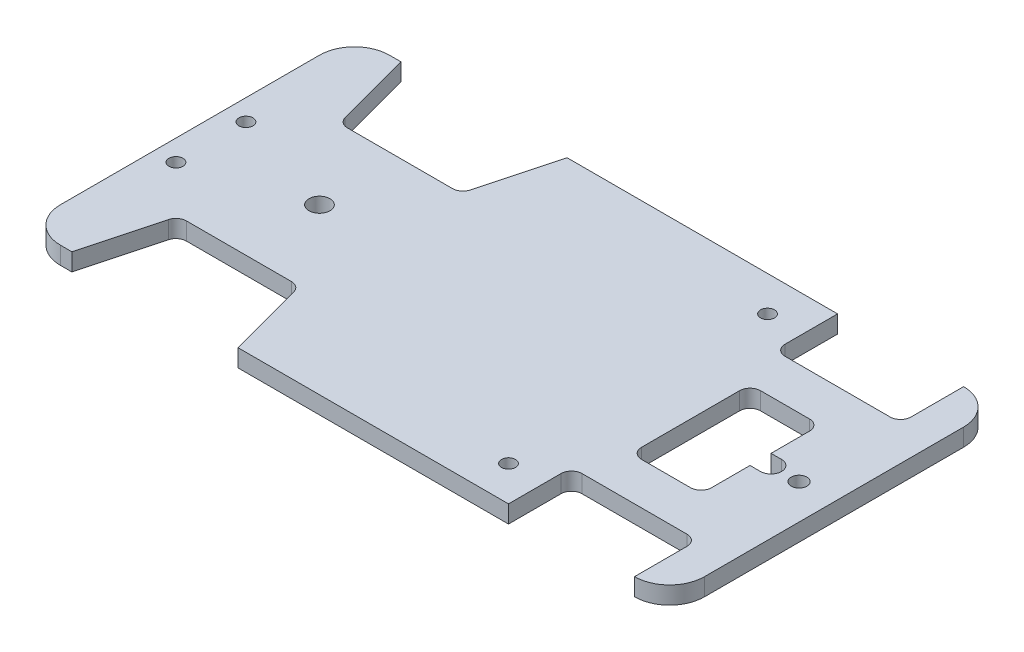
ISO-10303-21;
HEADER;
FILE_DESCRIPTION(('STEP AP214'),'2;1');
FILE_NAME('part.step','',(''),(''),'','','');
FILE_SCHEMA(('AUTOMOTIVE_DESIGN { 1 0 10303 214 1 1 1 1 }'));
ENDSEC;
DATA;
#1=APPLICATION_CONTEXT('core data for automotive mechanical design processes');
#2=APPLICATION_PROTOCOL_DEFINITION('international standard','automotive_design',2000,#1);
#3=PRODUCT_CONTEXT('',#1,'mechanical');
#4=PRODUCT('Part','Part','',(#3));
#5=PRODUCT_RELATED_PRODUCT_CATEGORY('part','',(#4));
#6=PRODUCT_DEFINITION_FORMATION('','',#4);
#7=PRODUCT_DEFINITION_CONTEXT('part definition',#1,'design');
#8=PRODUCT_DEFINITION('design','',#6,#7);
#9=PRODUCT_DEFINITION_SHAPE('','',#8);
#10=(LENGTH_UNIT() NAMED_UNIT(*) SI_UNIT(.MILLI.,.METRE.));
#11=(NAMED_UNIT(*) PLANE_ANGLE_UNIT() SI_UNIT($,.RADIAN.));
#12=(NAMED_UNIT(*) SI_UNIT($,.STERADIAN.) SOLID_ANGLE_UNIT());
#13=UNCERTAINTY_MEASURE_WITH_UNIT(LENGTH_MEASURE(1.E-05),#10,'distance_accuracy_value','');
#14=(GEOMETRIC_REPRESENTATION_CONTEXT(3) GLOBAL_UNCERTAINTY_ASSIGNED_CONTEXT((#13)) GLOBAL_UNIT_ASSIGNED_CONTEXT((#10,
#11,#12)) REPRESENTATION_CONTEXT('',''));
#15=CARTESIAN_POINT('',(0.,0.,0.));
#16=DIRECTION('',(0.,0.,1.));
#17=DIRECTION('',(1.,0.,0.));
#18=AXIS2_PLACEMENT_3D('',#15,#16,#17);
#19=CARTESIAN_POINT('',(22.,5.,-26.));
#20=DIRECTION('',(0.,-1.,0.));
#21=DIRECTION('',(0.,0.,-1.));
#22=AXIS2_PLACEMENT_3D('',#19,#20,#21);
#23=PLANE('',#22);
#24=CARTESIAN_POINT('',(128.,5.,-37.));
#25=DIRECTION('',(0.,1.,0.));
#26=DIRECTION('',(0.,0.,1.));
#27=AXIS2_PLACEMENT_3D('',#24,#25,#26);
#28=CIRCLE('',#27,2.);
#29=CARTESIAN_POINT('',(128.,5.,-35.));
#30=VERTEX_POINT('',#29);
#31=EDGE_CURVE('E1214',#30,#30,#28,.T.);
#32=ORIENTED_EDGE('',*,*,#31,.F.);
#33=EDGE_LOOP('',(#32));
#34=FACE_BOUND('',#33,.T.);
#35=CARTESIAN_POINT('',(146.,5.,-14.));
#36=DIRECTION('',(0.,1.,0.));
#37=DIRECTION('',(0.,0.,-1.));
#38=AXIS2_PLACEMENT_3D('',#35,#36,#37);
#39=CIRCLE('',#38,3.);
#40=CARTESIAN_POINT('',(146.,5.,-17.));
#41=VERTEX_POINT('',#40);
#42=CARTESIAN_POINT('',(143.,5.,-14.));
#43=VERTEX_POINT('',#42);
#44=EDGE_CURVE('E299',#41,#43,#39,.T.);
#45=ORIENTED_EDGE('',*,*,#44,.F.);
#46=DIRECTION('',(-1.,0.,0.));
#47=VECTOR('',#46,1.);
#48=CARTESIAN_POINT('',(160.,5.,-17.));
#49=LINE('',#48,#47);
#50=CARTESIAN_POINT('',(160.,5.,-17.));
#51=VERTEX_POINT('',#50);
#52=EDGE_CURVE('E342',#51,#41,#49,.T.);
#53=ORIENTED_EDGE('',*,*,#52,.F.);
#54=CARTESIAN_POINT('',(160.,5.,-14.));
#55=DIRECTION('',(0.,1.,0.));
#56=DIRECTION('',(0.,0.,1.));
#57=AXIS2_PLACEMENT_3D('',#54,#55,#56);
#58=CIRCLE('',#57,3.);
#59=CARTESIAN_POINT('',(163.,5.,-14.));
#60=VERTEX_POINT('',#59);
#61=EDGE_CURVE('E340',#60,#51,#58,.T.);
#62=ORIENTED_EDGE('',*,*,#61,.F.);
#63=DIRECTION('',(0.,0.,-1.));
#64=VECTOR('',#63,1.);
#65=CARTESIAN_POINT('',(163.,5.,-3.));
#66=LINE('',#65,#64);
#67=CARTESIAN_POINT('',(163.,5.,-3.));
#68=VERTEX_POINT('',#67);
#69=EDGE_CURVE('E338',#68,#60,#66,.T.);
#70=ORIENTED_EDGE('',*,*,#69,.F.);
#71=DIRECTION('',(-1.,0.,0.));
#72=VECTOR('',#71,1.);
#73=CARTESIAN_POINT('',(166.,5.,-3.));
#74=LINE('',#73,#72);
#75=CARTESIAN_POINT('',(166.,5.,-3.));
#76=VERTEX_POINT('',#75);
#77=EDGE_CURVE('E336',#76,#68,#74,.T.);
#78=ORIENTED_EDGE('',*,*,#77,.F.);
#79=CARTESIAN_POINT('',(166.,5.,0.));
#80=DIRECTION('',(0.,1.,0.));
#81=DIRECTION('',(0.,0.,1.));
#82=AXIS2_PLACEMENT_3D('',#79,#80,#81);
#83=CIRCLE('',#82,3.);
#84=CARTESIAN_POINT('',(166.,5.,3.));
#85=VERTEX_POINT('',#84);
#86=EDGE_CURVE('E334',#85,#76,#83,.T.);
#87=ORIENTED_EDGE('',*,*,#86,.F.);
#88=DIRECTION('',(1.,0.,0.));
#89=VECTOR('',#88,1.);
#90=CARTESIAN_POINT('',(166.,5.,3.));
#91=LINE('',#90,#89);
#92=CARTESIAN_POINT('',(163.,5.,3.));
#93=VERTEX_POINT('',#92);
#94=EDGE_CURVE('E332',#93,#85,#91,.T.);
#95=ORIENTED_EDGE('',*,*,#94,.F.);
#96=DIRECTION('',(0.,0.,-1.));
#97=VECTOR('',#96,1.);
#98=CARTESIAN_POINT('',(163.,5.,3.));
#99=LINE('',#98,#97);
#100=CARTESIAN_POINT('',(163.,5.,14.));
#101=VERTEX_POINT('',#100);
#102=EDGE_CURVE('E330',#101,#93,#99,.T.);
#103=ORIENTED_EDGE('',*,*,#102,.F.);
#104=CARTESIAN_POINT('',(160.,5.,14.));
#105=DIRECTION('',(0.,1.,0.));
#106=DIRECTION('',(0.,0.,-1.));
#107=AXIS2_PLACEMENT_3D('',#104,#105,#106);
#108=CIRCLE('',#107,3.);
#109=CARTESIAN_POINT('',(160.,5.,17.));
#110=VERTEX_POINT('',#109);
#111=EDGE_CURVE('E328',#110,#101,#108,.T.);
#112=ORIENTED_EDGE('',*,*,#111,.F.);
#113=DIRECTION('',(1.,0.,0.));
#114=VECTOR('',#113,1.);
#115=CARTESIAN_POINT('',(160.,5.,17.));
#116=LINE('',#115,#114);
#117=CARTESIAN_POINT('',(146.,5.,17.));
#118=VERTEX_POINT('',#117);
#119=EDGE_CURVE('E323',#118,#110,#116,.T.);
#120=ORIENTED_EDGE('',*,*,#119,.F.);
#121=CARTESIAN_POINT('',(146.,5.,14.));
#122=DIRECTION('',(0.,1.,0.));
#123=DIRECTION('',(0.,0.,1.));
#124=AXIS2_PLACEMENT_3D('',#121,#122,#123);
#125=CIRCLE('',#124,3.);
#126=CARTESIAN_POINT('',(143.,5.,14.));
#127=VERTEX_POINT('',#126);
#128=EDGE_CURVE('E321',#127,#118,#125,.T.);
#129=ORIENTED_EDGE('',*,*,#128,.F.);
#130=DIRECTION('',(0.,0.,1.));
#131=VECTOR('',#130,1.);
#132=CARTESIAN_POINT('',(143.,5.,-14.));
#133=LINE('',#132,#131);
#134=EDGE_CURVE('E307',#43,#127,#133,.T.);
#135=ORIENTED_EDGE('',*,*,#134,.F.);
#136=EDGE_LOOP('',(#45,#53,#62,#70,#78,#87,#95,#103,#112,#120,#129,#135));
#137=FACE_BOUND('',#136,.T.);
#138=CARTESIAN_POINT('',(37.,5.,0.));
#139=DIRECTION('',(0.,1.,0.));
#140=DIRECTION('',(0.,0.,1.));
#141=AXIS2_PLACEMENT_3D('',#138,#139,#140);
#142=CIRCLE('',#141,3.);
#143=CARTESIAN_POINT('',(37.,5.,3.));
#144=VERTEX_POINT('',#143);
#145=EDGE_CURVE('E401',#144,#144,#142,.T.);
#146=ORIENTED_EDGE('',*,*,#145,.F.);
#147=EDGE_LOOP('',(#146));
#148=FACE_BOUND('',#147,.T.);
#149=CARTESIAN_POINT('',(22.,5.,-26.));
#150=DIRECTION('',(0.,-1.,0.));
#151=DIRECTION('',(0.,0.,-1.));
#152=AXIS2_PLACEMENT_3D('',#149,#150,#151);
#153=CIRCLE('',#152,3.);
#154=CARTESIAN_POINT('',(22.,5.,-23.));
#155=VERTEX_POINT('',#154);
#156=CARTESIAN_POINT('',(19.1022225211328,5.,-25.2235428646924));
#157=VERTEX_POINT('',#156);
#158=EDGE_CURVE('E413',#155,#157,#153,.T.);
#159=ORIENTED_EDGE('',*,*,#158,.T.);
#160=DIRECTION('',(-0.258819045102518,0.,-0.965925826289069));
#161=VECTOR('',#160,1.);
#162=CARTESIAN_POINT('',(13.2672384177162,5.,-47.));
#163=LINE('',#162,#161);
#164=CARTESIAN_POINT('',(13.2672384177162,5.,-47.));
#165=VERTEX_POINT('',#164);
#166=EDGE_CURVE('E416',#157,#165,#163,.T.);
#167=ORIENTED_EDGE('',*,*,#166,.T.);
#168=DIRECTION('',(-1.,0.,0.));
#169=VECTOR('',#168,1.);
#170=CARTESIAN_POINT('',(10.0000000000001,5.,-47.));
#171=LINE('',#170,#169);
#172=CARTESIAN_POINT('',(10.0000000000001,5.,-47.));
#173=VERTEX_POINT('',#172);
#174=EDGE_CURVE('E419',#165,#173,#171,.T.);
#175=ORIENTED_EDGE('',*,*,#174,.T.);
#176=CARTESIAN_POINT('',(10.,5.,-37.));
#177=DIRECTION('',(0.,1.,0.));
#178=DIRECTION('',(0.,0.,-1.));
#179=AXIS2_PLACEMENT_3D('',#176,#177,#178);
#180=CIRCLE('',#179,10.);
#181=CARTESIAN_POINT('',(0.,5.,-36.9999999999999));
#182=VERTEX_POINT('',#181);
#183=EDGE_CURVE('E421',#173,#182,#180,.T.);
#184=ORIENTED_EDGE('',*,*,#183,.T.);
#185=DIRECTION('',(0.,0.,1.));
#186=VECTOR('',#185,1.);
#187=CARTESIAN_POINT('',(0.,5.,36.9999999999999));
#188=LINE('',#187,#186);
#189=CARTESIAN_POINT('',(0.,5.,36.9999999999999));
#190=VERTEX_POINT('',#189);
#191=EDGE_CURVE('E423',#182,#190,#188,.T.);
#192=ORIENTED_EDGE('',*,*,#191,.T.);
#193=CARTESIAN_POINT('',(10.,5.,37.));
#194=DIRECTION('',(0.,1.,0.));
#195=DIRECTION('',(0.,0.,1.));
#196=AXIS2_PLACEMENT_3D('',#193,#194,#195);
#197=CIRCLE('',#196,10.);
#198=CARTESIAN_POINT('',(10.0000000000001,5.,47.));
#199=VERTEX_POINT('',#198);
#200=EDGE_CURVE('E425',#190,#199,#197,.T.);
#201=ORIENTED_EDGE('',*,*,#200,.T.);
#202=DIRECTION('',(1.,0.,0.));
#203=VECTOR('',#202,1.);
#204=CARTESIAN_POINT('',(10.0000000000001,5.,47.));
#205=LINE('',#204,#203);
#206=CARTESIAN_POINT('',(13.2672384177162,5.,47.));
#207=VERTEX_POINT('',#206);
#208=EDGE_CURVE('E427',#199,#207,#205,.T.);
#209=ORIENTED_EDGE('',*,*,#208,.T.);
#210=DIRECTION('',(0.258819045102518,0.,-0.965925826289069));
#211=VECTOR('',#210,1.);
#212=CARTESIAN_POINT('',(13.2672384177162,5.,47.));
#213=LINE('',#212,#211);
#214=CARTESIAN_POINT('',(19.1022225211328,5.,25.2235428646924));
#215=VERTEX_POINT('',#214);
#216=EDGE_CURVE('E429',#207,#215,#213,.T.);
#217=ORIENTED_EDGE('',*,*,#216,.T.);
#218=CARTESIAN_POINT('',(22.,5.,26.));
#219=DIRECTION('',(0.,-1.,0.));
#220=DIRECTION('',(0.,0.,1.));
#221=AXIS2_PLACEMENT_3D('',#218,#219,#220);
#222=CIRCLE('',#221,3.);
#223=CARTESIAN_POINT('',(22.,5.,23.));
#224=VERTEX_POINT('',#223);
#225=EDGE_CURVE('E431',#215,#224,#222,.T.);
#226=ORIENTED_EDGE('',*,*,#225,.T.);
#227=DIRECTION('',(1.,0.,0.));
#228=VECTOR('',#227,1.);
#229=CARTESIAN_POINT('',(22.,5.,23.));
#230=LINE('',#229,#228);
#231=CARTESIAN_POINT('',(52.,5.,23.));
#232=VERTEX_POINT('',#231);
#233=EDGE_CURVE('E433',#224,#232,#230,.T.);
#234=ORIENTED_EDGE('',*,*,#233,.T.);
#235=CARTESIAN_POINT('',(52.,5.,26.));
#236=DIRECTION('',(0.,-1.,0.));
#237=DIRECTION('',(0.,0.,-1.));
#238=AXIS2_PLACEMENT_3D('',#235,#236,#237);
#239=CIRCLE('',#238,3.);
#240=CARTESIAN_POINT('',(54.8977774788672,5.,25.2235428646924));
#241=VERTEX_POINT('',#240);
#242=EDGE_CURVE('E435',#232,#241,#239,.T.);
#243=ORIENTED_EDGE('',*,*,#242,.T.);
#244=DIRECTION('',(0.258819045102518,0.,0.965925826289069));
#245=VECTOR('',#244,1.);
#246=CARTESIAN_POINT('',(54.8977774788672,5.,25.2235428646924));
#247=LINE('',#246,#245);
#248=CARTESIAN_POINT('',(60.7327615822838,5.,47.));
#249=VERTEX_POINT('',#248);
#250=EDGE_CURVE('E437',#241,#249,#247,.T.);
#251=ORIENTED_EDGE('',*,*,#250,.T.);
#252=DIRECTION('',(1.,0.,0.));
#253=VECTOR('',#252,1.);
#254=CARTESIAN_POINT('',(60.7327615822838,5.,47.));
#255=LINE('',#254,#253);
#256=CARTESIAN_POINT('',(138.,5.,47.));
#257=VERTEX_POINT('',#256);
#258=EDGE_CURVE('E439',#249,#257,#255,.T.);
#259=ORIENTED_EDGE('',*,*,#258,.T.);
#260=DIRECTION('',(0.,0.,-1.));
#261=VECTOR('',#260,1.);
#262=CARTESIAN_POINT('',(138.,5.,47.));
#263=LINE('',#262,#261);
#264=CARTESIAN_POINT('',(138.,5.,32.));
#265=VERTEX_POINT('',#264);
#266=EDGE_CURVE('E441',#257,#265,#263,.T.);
#267=ORIENTED_EDGE('',*,*,#266,.T.);
#268=CARTESIAN_POINT('',(141.,5.,32.));
#269=DIRECTION('',(0.,-1.,0.));
#270=DIRECTION('',(0.,0.,1.));
#271=AXIS2_PLACEMENT_3D('',#268,#269,#270);
#272=CIRCLE('',#271,3.);
#273=CARTESIAN_POINT('',(141.,5.,29.));
#274=VERTEX_POINT('',#273);
#275=EDGE_CURVE('E443',#265,#274,#272,.T.);
#276=ORIENTED_EDGE('',*,*,#275,.T.);
#277=DIRECTION('',(1.,0.,0.));
#278=VECTOR('',#277,1.);
#279=CARTESIAN_POINT('',(141.,5.,29.));
#280=LINE('',#279,#278);
#281=CARTESIAN_POINT('',(171.,5.,29.));
#282=VERTEX_POINT('',#281);
#283=EDGE_CURVE('E445',#274,#282,#280,.T.);
#284=ORIENTED_EDGE('',*,*,#283,.T.);
#285=CARTESIAN_POINT('',(171.,5.,32.));
#286=DIRECTION('',(0.,-1.,0.));
#287=DIRECTION('',(0.,0.,1.));
#288=AXIS2_PLACEMENT_3D('',#285,#286,#287);
#289=CIRCLE('',#288,3.);
#290=CARTESIAN_POINT('',(174.,5.,32.));
#291=VERTEX_POINT('',#290);
#292=EDGE_CURVE('E447',#282,#291,#289,.T.);
#293=ORIENTED_EDGE('',*,*,#292,.T.);
#294=DIRECTION('',(0.,0.,1.));
#295=VECTOR('',#294,1.);
#296=CARTESIAN_POINT('',(174.,5.,32.));
#297=LINE('',#296,#295);
#298=CARTESIAN_POINT('',(174.,5.,47.));
#299=VERTEX_POINT('',#298);
#300=EDGE_CURVE('E449',#291,#299,#297,.T.);
#301=ORIENTED_EDGE('',*,*,#300,.T.);
#302=CARTESIAN_POINT('',(174.,5.,37.));
#303=DIRECTION('',(0.,1.,0.));
#304=DIRECTION('',(0.,0.,-1.));
#305=AXIS2_PLACEMENT_3D('',#302,#303,#304);
#306=CIRCLE('',#305,10.);
#307=CARTESIAN_POINT('',(184.,5.,37.));
#308=VERTEX_POINT('',#307);
#309=EDGE_CURVE('E451',#299,#308,#306,.T.);
#310=ORIENTED_EDGE('',*,*,#309,.T.);
#311=DIRECTION('',(0.,0.,-1.));
#312=VECTOR('',#311,1.);
#313=CARTESIAN_POINT('',(184.,5.,-37.));
#314=LINE('',#313,#312);
#315=CARTESIAN_POINT('',(184.,5.,-37.));
#316=VERTEX_POINT('',#315);
#317=EDGE_CURVE('E453',#308,#316,#314,.T.);
#318=ORIENTED_EDGE('',*,*,#317,.T.);
#319=CARTESIAN_POINT('',(174.,5.,-37.));
#320=DIRECTION('',(0.,1.,0.));
#321=DIRECTION('',(0.,0.,1.));
#322=AXIS2_PLACEMENT_3D('',#319,#320,#321);
#323=CIRCLE('',#322,10.);
#324=CARTESIAN_POINT('',(174.,5.,-47.));
#325=VERTEX_POINT('',#324);
#326=EDGE_CURVE('E455',#316,#325,#323,.T.);
#327=ORIENTED_EDGE('',*,*,#326,.T.);
#328=DIRECTION('',(0.,0.,1.));
#329=VECTOR('',#328,1.);
#330=CARTESIAN_POINT('',(174.,5.,-32.));
#331=LINE('',#330,#329);
#332=CARTESIAN_POINT('',(174.,5.,-32.));
#333=VERTEX_POINT('',#332);
#334=EDGE_CURVE('E457',#325,#333,#331,.T.);
#335=ORIENTED_EDGE('',*,*,#334,.T.);
#336=CARTESIAN_POINT('',(171.,5.,-32.));
#337=DIRECTION('',(0.,-1.,0.));
#338=DIRECTION('',(0.,0.,-1.));
#339=AXIS2_PLACEMENT_3D('',#336,#337,#338);
#340=CIRCLE('',#339,3.);
#341=CARTESIAN_POINT('',(171.,5.,-29.));
#342=VERTEX_POINT('',#341);
#343=EDGE_CURVE('E459',#333,#342,#340,.T.);
#344=ORIENTED_EDGE('',*,*,#343,.T.);
#345=DIRECTION('',(-1.,0.,0.));
#346=VECTOR('',#345,1.);
#347=CARTESIAN_POINT('',(141.,5.,-29.));
#348=LINE('',#347,#346);
#349=CARTESIAN_POINT('',(141.,5.,-29.));
#350=VERTEX_POINT('',#349);
#351=EDGE_CURVE('E461',#342,#350,#348,.T.);
#352=ORIENTED_EDGE('',*,*,#351,.T.);
#353=CARTESIAN_POINT('',(141.,5.,-32.));
#354=DIRECTION('',(0.,-1.,0.));
#355=DIRECTION('',(0.,0.,-1.));
#356=AXIS2_PLACEMENT_3D('',#353,#354,#355);
#357=CIRCLE('',#356,3.);
#358=CARTESIAN_POINT('',(138.,5.,-32.));
#359=VERTEX_POINT('',#358);
#360=EDGE_CURVE('E463',#350,#359,#357,.T.);
#361=ORIENTED_EDGE('',*,*,#360,.T.);
#362=DIRECTION('',(0.,0.,-1.));
#363=VECTOR('',#362,1.);
#364=CARTESIAN_POINT('',(138.,5.,-47.));
#365=LINE('',#364,#363);
#366=CARTESIAN_POINT('',(138.,5.,-47.));
#367=VERTEX_POINT('',#366);
#368=EDGE_CURVE('E465',#359,#367,#365,.T.);
#369=ORIENTED_EDGE('',*,*,#368,.T.);
#370=DIRECTION('',(-1.,0.,0.));
#371=VECTOR('',#370,1.);
#372=CARTESIAN_POINT('',(60.7327615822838,5.,-47.));
#373=LINE('',#372,#371);
#374=CARTESIAN_POINT('',(60.7327615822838,5.,-47.));
#375=VERTEX_POINT('',#374);
#376=EDGE_CURVE('E467',#367,#375,#373,.T.);
#377=ORIENTED_EDGE('',*,*,#376,.T.);
#378=DIRECTION('',(-0.258819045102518,0.,0.965925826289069));
#379=VECTOR('',#378,1.);
#380=CARTESIAN_POINT('',(54.8977774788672,5.,-25.2235428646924));
#381=LINE('',#380,#379);
#382=CARTESIAN_POINT('',(54.8977774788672,5.,-25.2235428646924));
#383=VERTEX_POINT('',#382);
#384=EDGE_CURVE('E469',#375,#383,#381,.T.);
#385=ORIENTED_EDGE('',*,*,#384,.T.);
#386=CARTESIAN_POINT('',(52.,5.,-26.));
#387=DIRECTION('',(0.,-1.,0.));
#388=DIRECTION('',(0.,0.,1.));
#389=AXIS2_PLACEMENT_3D('',#386,#387,#388);
#390=CIRCLE('',#389,3.);
#391=CARTESIAN_POINT('',(52.,5.,-23.));
#392=VERTEX_POINT('',#391);
#393=EDGE_CURVE('E471',#383,#392,#390,.T.);
#394=ORIENTED_EDGE('',*,*,#393,.T.);
#395=DIRECTION('',(-1.,0.,0.));
#396=VECTOR('',#395,1.);
#397=CARTESIAN_POINT('',(22.,5.,-23.));
#398=LINE('',#397,#396);
#399=EDGE_CURVE('E473',#392,#155,#398,.T.);
#400=ORIENTED_EDGE('',*,*,#399,.T.);
#401=EDGE_LOOP('',(#159,#167,#175,#184,#192,#201,#209,#217,#226,#234,#243,#251,#259,#267,#276,
#284,#293,#301,#310,#318,#327,#335,#344,#352,#361,#369,#377,#385,#394,#400));
#402=FACE_BOUND('',#401,.T.);
#403=CARTESIAN_POINT('',(174.,5.,0.));
#404=DIRECTION('',(0.,1.,0.));
#405=DIRECTION('',(0.,0.,1.));
#406=AXIS2_PLACEMENT_3D('',#403,#404,#405);
#407=CIRCLE('',#406,2.25000000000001);
#408=CARTESIAN_POINT('',(174.,5.,2.25000000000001));
#409=VERTEX_POINT('',#408);
#410=EDGE_CURVE('E407',#409,#409,#407,.T.);
#411=ORIENTED_EDGE('',*,*,#410,.F.);
#412=EDGE_LOOP('',(#411));
#413=FACE_BOUND('',#412,.T.);
#414=CARTESIAN_POINT('',(6.,5.,-10.));
#415=DIRECTION('',(0.,1.,0.));
#416=DIRECTION('',(0.,0.,1.));
#417=AXIS2_PLACEMENT_3D('',#414,#415,#416);
#418=CIRCLE('',#417,2.);
#419=CARTESIAN_POINT('',(6.,5.,-8.));
#420=VERTEX_POINT('',#419);
#421=EDGE_CURVE('E395',#420,#420,#418,.T.);
#422=ORIENTED_EDGE('',*,*,#421,.F.);
#423=EDGE_LOOP('',(#422));
#424=FACE_BOUND('',#423,.T.);
#425=CARTESIAN_POINT('',(6.,5.,10.));
#426=DIRECTION('',(0.,1.,0.));
#427=DIRECTION('',(0.,0.,-1.));
#428=AXIS2_PLACEMENT_3D('',#425,#426,#427);
#429=CIRCLE('',#428,2.);
#430=CARTESIAN_POINT('',(6.,5.,8.));
#431=VERTEX_POINT('',#430);
#432=EDGE_CURVE('E345',#431,#431,#429,.T.);
#433=ORIENTED_EDGE('',*,*,#432,.F.);
#434=EDGE_LOOP('',(#433));
#435=FACE_BOUND('',#434,.T.);
#436=CARTESIAN_POINT('',(128.,5.,37.));
#437=DIRECTION('',(0.,1.,0.));
#438=DIRECTION('',(0.,0.,-1.));
#439=AXIS2_PLACEMENT_3D('',#436,#437,#438);
#440=CIRCLE('',#439,2.);
#441=CARTESIAN_POINT('',(128.,5.,35.));
#442=VERTEX_POINT('',#441);
#443=EDGE_CURVE('E1205',#442,#442,#440,.T.);
#444=ORIENTED_EDGE('',*,*,#443,.F.);
#445=EDGE_LOOP('',(#444));
#446=FACE_BOUND('',#445,.T.);
#447=ADVANCED_FACE('F30',(#34,#137,#148,#402,#413,#424,#435,#446),#23,.F.);
#448=CARTESIAN_POINT('',(22.,0.,-26.));
#449=DIRECTION('',(0.,-1.,0.));
#450=DIRECTION('',(0.,0.,-1.));
#451=AXIS2_PLACEMENT_3D('',#448,#449,#450);
#452=PLANE('',#451);
#453=CARTESIAN_POINT('',(128.,0.,-37.));
#454=DIRECTION('',(0.,1.,0.));
#455=DIRECTION('',(0.,0.,1.));
#456=AXIS2_PLACEMENT_3D('',#453,#454,#455);
#457=CIRCLE('',#456,2.);
#458=CARTESIAN_POINT('',(128.,0.,-35.));
#459=VERTEX_POINT('',#458);
#460=EDGE_CURVE('E1211',#459,#459,#457,.T.);
#461=ORIENTED_EDGE('',*,*,#460,.T.);
#462=EDGE_LOOP('',(#461));
#463=FACE_BOUND('',#462,.T.);
#464=DIRECTION('',(-1.,0.,0.));
#465=VECTOR('',#464,1.);
#466=CARTESIAN_POINT('',(160.,0.,-17.));
#467=LINE('',#466,#465);
#468=CARTESIAN_POINT('',(160.,0.,-17.));
#469=VERTEX_POINT('',#468);
#470=CARTESIAN_POINT('',(146.,0.,-17.));
#471=VERTEX_POINT('',#470);
#472=EDGE_CURVE('E308',#469,#471,#467,.T.);
#473=ORIENTED_EDGE('',*,*,#472,.T.);
#474=CARTESIAN_POINT('',(146.,0.,-14.));
#475=DIRECTION('',(0.,1.,0.));
#476=DIRECTION('',(0.,0.,-1.));
#477=AXIS2_PLACEMENT_3D('',#474,#475,#476);
#478=CIRCLE('',#477,3.);
#479=CARTESIAN_POINT('',(143.,0.,-14.));
#480=VERTEX_POINT('',#479);
#481=EDGE_CURVE('E53',#471,#480,#478,.T.);
#482=ORIENTED_EDGE('',*,*,#481,.T.);
#483=DIRECTION('',(0.,0.,1.));
#484=VECTOR('',#483,1.);
#485=CARTESIAN_POINT('',(143.,0.,-14.));
#486=LINE('',#485,#484);
#487=CARTESIAN_POINT('',(143.,0.,14.));
#488=VERTEX_POINT('',#487);
#489=EDGE_CURVE('E314',#480,#488,#486,.T.);
#490=ORIENTED_EDGE('',*,*,#489,.T.);
#491=CARTESIAN_POINT('',(146.,0.,14.));
#492=DIRECTION('',(0.,1.,0.));
#493=DIRECTION('',(0.,0.,1.));
#494=AXIS2_PLACEMENT_3D('',#491,#492,#493);
#495=CIRCLE('',#494,3.);
#496=CARTESIAN_POINT('',(146.,0.,17.));
#497=VERTEX_POINT('',#496);
#498=EDGE_CURVE('E347',#488,#497,#495,.T.);
#499=ORIENTED_EDGE('',*,*,#498,.T.);
#500=DIRECTION('',(1.,0.,0.));
#501=VECTOR('',#500,1.);
#502=CARTESIAN_POINT('',(160.,0.,17.));
#503=LINE('',#502,#501);
#504=CARTESIAN_POINT('',(160.,0.,17.));
#505=VERTEX_POINT('',#504);
#506=EDGE_CURVE('E350',#497,#505,#503,.T.);
#507=ORIENTED_EDGE('',*,*,#506,.T.);
#508=CARTESIAN_POINT('',(160.,0.,14.));
#509=DIRECTION('',(0.,1.,0.));
#510=DIRECTION('',(0.,0.,-1.));
#511=AXIS2_PLACEMENT_3D('',#508,#509,#510);
#512=CIRCLE('',#511,3.);
#513=CARTESIAN_POINT('',(163.,0.,14.));
#514=VERTEX_POINT('',#513);
#515=EDGE_CURVE('E353',#505,#514,#512,.T.);
#516=ORIENTED_EDGE('',*,*,#515,.T.);
#517=DIRECTION('',(0.,0.,-1.));
#518=VECTOR('',#517,1.);
#519=CARTESIAN_POINT('',(163.,0.,3.));
#520=LINE('',#519,#518);
#521=CARTESIAN_POINT('',(163.,0.,3.));
#522=VERTEX_POINT('',#521);
#523=EDGE_CURVE('E356',#514,#522,#520,.T.);
#524=ORIENTED_EDGE('',*,*,#523,.T.);
#525=DIRECTION('',(1.,0.,0.));
#526=VECTOR('',#525,1.);
#527=CARTESIAN_POINT('',(166.,0.,3.));
#528=LINE('',#527,#526);
#529=CARTESIAN_POINT('',(166.,0.,3.));
#530=VERTEX_POINT('',#529);
#531=EDGE_CURVE('E359',#522,#530,#528,.T.);
#532=ORIENTED_EDGE('',*,*,#531,.T.);
#533=CARTESIAN_POINT('',(166.,0.,0.));
#534=DIRECTION('',(0.,1.,0.));
#535=DIRECTION('',(0.,0.,1.));
#536=AXIS2_PLACEMENT_3D('',#533,#534,#535);
#537=CIRCLE('',#536,3.);
#538=CARTESIAN_POINT('',(166.,0.,-3.));
#539=VERTEX_POINT('',#538);
#540=EDGE_CURVE('E362',#530,#539,#537,.T.);
#541=ORIENTED_EDGE('',*,*,#540,.T.);
#542=DIRECTION('',(-1.,0.,0.));
#543=VECTOR('',#542,1.);
#544=CARTESIAN_POINT('',(166.,0.,-3.));
#545=LINE('',#544,#543);
#546=CARTESIAN_POINT('',(163.,0.,-3.));
#547=VERTEX_POINT('',#546);
#548=EDGE_CURVE('E365',#539,#547,#545,.T.);
#549=ORIENTED_EDGE('',*,*,#548,.T.);
#550=DIRECTION('',(0.,0.,-1.));
#551=VECTOR('',#550,1.);
#552=CARTESIAN_POINT('',(163.,0.,-3.));
#553=LINE('',#552,#551);
#554=CARTESIAN_POINT('',(163.,0.,-14.));
#555=VERTEX_POINT('',#554);
#556=EDGE_CURVE('E368',#547,#555,#553,.T.);
#557=ORIENTED_EDGE('',*,*,#556,.T.);
#558=CARTESIAN_POINT('',(160.,0.,-14.));
#559=DIRECTION('',(0.,1.,0.));
#560=DIRECTION('',(0.,0.,1.));
#561=AXIS2_PLACEMENT_3D('',#558,#559,#560);
#562=CIRCLE('',#561,3.);
#563=EDGE_CURVE('E371',#555,#469,#562,.T.);
#564=ORIENTED_EDGE('',*,*,#563,.T.);
#565=EDGE_LOOP('',(#473,#482,#490,#499,#507,#516,#524,#532,#541,#549,#557,#564));
#566=FACE_BOUND('',#565,.T.);
#567=CARTESIAN_POINT('',(37.,0.,0.));
#568=DIRECTION('',(0.,1.,0.));
#569=DIRECTION('',(0.,0.,1.));
#570=AXIS2_PLACEMENT_3D('',#567,#568,#569);
#571=CIRCLE('',#570,3.);
#572=CARTESIAN_POINT('',(37.,0.,3.));
#573=VERTEX_POINT('',#572);
#574=EDGE_CURVE('E398',#573,#573,#571,.T.);
#575=ORIENTED_EDGE('',*,*,#574,.T.);
#576=EDGE_LOOP('',(#575));
#577=FACE_BOUND('',#576,.T.);
#578=CARTESIAN_POINT('',(22.,0.,-26.));
#579=DIRECTION('',(0.,-1.,0.));
#580=DIRECTION('',(0.,0.,-1.));
#581=AXIS2_PLACEMENT_3D('',#578,#579,#580);
#582=CIRCLE('',#581,3.);
#583=CARTESIAN_POINT('',(22.,0.,-23.));
#584=VERTEX_POINT('',#583);
#585=CARTESIAN_POINT('',(19.1022225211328,0.,-25.2235428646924));
#586=VERTEX_POINT('',#585);
#587=EDGE_CURVE('E410',#584,#586,#582,.T.);
#588=ORIENTED_EDGE('',*,*,#587,.F.);
#589=DIRECTION('',(-1.,0.,0.));
#590=VECTOR('',#589,1.);
#591=CARTESIAN_POINT('',(22.,0.,-23.));
#592=LINE('',#591,#590);
#593=CARTESIAN_POINT('',(52.,0.,-23.));
#594=VERTEX_POINT('',#593);
#595=EDGE_CURVE('E417',#594,#584,#592,.T.);
#596=ORIENTED_EDGE('',*,*,#595,.F.);
#597=CARTESIAN_POINT('',(52.,0.,-26.));
#598=DIRECTION('',(0.,-1.,0.));
#599=DIRECTION('',(0.,0.,1.));
#600=AXIS2_PLACEMENT_3D('',#597,#598,#599);
#601=CIRCLE('',#600,3.);
#602=CARTESIAN_POINT('',(54.8977774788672,0.,-25.2235428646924));
#603=VERTEX_POINT('',#602);
#604=EDGE_CURVE('E532',#603,#594,#601,.T.);
#605=ORIENTED_EDGE('',*,*,#604,.F.);
#606=DIRECTION('',(-0.258819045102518,0.,0.965925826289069));
#607=VECTOR('',#606,1.);
#608=CARTESIAN_POINT('',(54.8977774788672,0.,-25.2235428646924));
#609=LINE('',#608,#607);
#610=CARTESIAN_POINT('',(60.7327615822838,0.,-47.));
#611=VERTEX_POINT('',#610);
#612=EDGE_CURVE('E530',#611,#603,#609,.T.);
#613=ORIENTED_EDGE('',*,*,#612,.F.);
#614=DIRECTION('',(-1.,0.,0.));
#615=VECTOR('',#614,1.);
#616=CARTESIAN_POINT('',(60.7327615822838,0.,-47.));
#617=LINE('',#616,#615);
#618=CARTESIAN_POINT('',(138.,0.,-47.));
#619=VERTEX_POINT('',#618);
#620=EDGE_CURVE('E528',#619,#611,#617,.T.);
#621=ORIENTED_EDGE('',*,*,#620,.F.);
#622=DIRECTION('',(0.,0.,-1.));
#623=VECTOR('',#622,1.);
#624=CARTESIAN_POINT('',(138.,0.,-47.));
#625=LINE('',#624,#623);
#626=CARTESIAN_POINT('',(138.,0.,-32.));
#627=VERTEX_POINT('',#626);
#628=EDGE_CURVE('E526',#627,#619,#625,.T.);
#629=ORIENTED_EDGE('',*,*,#628,.F.);
#630=CARTESIAN_POINT('',(141.,0.,-32.));
#631=DIRECTION('',(0.,-1.,0.));
#632=DIRECTION('',(0.,0.,-1.));
#633=AXIS2_PLACEMENT_3D('',#630,#631,#632);
#634=CIRCLE('',#633,3.);
#635=CARTESIAN_POINT('',(141.,0.,-29.));
#636=VERTEX_POINT('',#635);
#637=EDGE_CURVE('E524',#636,#627,#634,.T.);
#638=ORIENTED_EDGE('',*,*,#637,.F.);
#639=DIRECTION('',(-1.,0.,0.));
#640=VECTOR('',#639,1.);
#641=CARTESIAN_POINT('',(141.,0.,-29.));
#642=LINE('',#641,#640);
#643=CARTESIAN_POINT('',(171.,0.,-29.));
#644=VERTEX_POINT('',#643);
#645=EDGE_CURVE('E522',#644,#636,#642,.T.);
#646=ORIENTED_EDGE('',*,*,#645,.F.);
#647=CARTESIAN_POINT('',(171.,0.,-32.));
#648=DIRECTION('',(0.,-1.,0.));
#649=DIRECTION('',(0.,0.,-1.));
#650=AXIS2_PLACEMENT_3D('',#647,#648,#649);
#651=CIRCLE('',#650,3.);
#652=CARTESIAN_POINT('',(174.,0.,-32.));
#653=VERTEX_POINT('',#652);
#654=EDGE_CURVE('E520',#653,#644,#651,.T.);
#655=ORIENTED_EDGE('',*,*,#654,.F.);
#656=DIRECTION('',(0.,0.,1.));
#657=VECTOR('',#656,1.);
#658=CARTESIAN_POINT('',(174.,0.,-32.));
#659=LINE('',#658,#657);
#660=CARTESIAN_POINT('',(174.,0.,-47.));
#661=VERTEX_POINT('',#660);
#662=EDGE_CURVE('E518',#661,#653,#659,.T.);
#663=ORIENTED_EDGE('',*,*,#662,.F.);
#664=CARTESIAN_POINT('',(174.,0.,-37.));
#665=DIRECTION('',(0.,1.,0.));
#666=DIRECTION('',(0.,0.,1.));
#667=AXIS2_PLACEMENT_3D('',#664,#665,#666);
#668=CIRCLE('',#667,10.);
#669=CARTESIAN_POINT('',(184.,0.,-37.));
#670=VERTEX_POINT('',#669);
#671=EDGE_CURVE('E516',#670,#661,#668,.T.);
#672=ORIENTED_EDGE('',*,*,#671,.F.);
#673=DIRECTION('',(0.,0.,-1.));
#674=VECTOR('',#673,1.);
#675=CARTESIAN_POINT('',(184.,0.,-37.));
#676=LINE('',#675,#674);
#677=CARTESIAN_POINT('',(184.,0.,37.));
#678=VERTEX_POINT('',#677);
#679=EDGE_CURVE('E514',#678,#670,#676,.T.);
#680=ORIENTED_EDGE('',*,*,#679,.F.);
#681=CARTESIAN_POINT('',(174.,0.,37.));
#682=DIRECTION('',(0.,1.,0.));
#683=DIRECTION('',(0.,0.,-1.));
#684=AXIS2_PLACEMENT_3D('',#681,#682,#683);
#685=CIRCLE('',#684,10.);
#686=CARTESIAN_POINT('',(174.,0.,47.));
#687=VERTEX_POINT('',#686);
#688=EDGE_CURVE('E512',#687,#678,#685,.T.);
#689=ORIENTED_EDGE('',*,*,#688,.F.);
#690=DIRECTION('',(0.,0.,1.));
#691=VECTOR('',#690,1.);
#692=CARTESIAN_POINT('',(174.,0.,32.));
#693=LINE('',#692,#691);
#694=CARTESIAN_POINT('',(174.,0.,32.));
#695=VERTEX_POINT('',#694);
#696=EDGE_CURVE('E510',#695,#687,#693,.T.);
#697=ORIENTED_EDGE('',*,*,#696,.F.);
#698=CARTESIAN_POINT('',(171.,0.,32.));
#699=DIRECTION('',(0.,-1.,0.));
#700=DIRECTION('',(0.,0.,1.));
#701=AXIS2_PLACEMENT_3D('',#698,#699,#700);
#702=CIRCLE('',#701,3.);
#703=CARTESIAN_POINT('',(171.,0.,29.));
#704=VERTEX_POINT('',#703);
#705=EDGE_CURVE('E508',#704,#695,#702,.T.);
#706=ORIENTED_EDGE('',*,*,#705,.F.);
#707=DIRECTION('',(1.,0.,0.));
#708=VECTOR('',#707,1.);
#709=CARTESIAN_POINT('',(141.,0.,29.));
#710=LINE('',#709,#708);
#711=CARTESIAN_POINT('',(141.,0.,29.));
#712=VERTEX_POINT('',#711);
#713=EDGE_CURVE('E506',#712,#704,#710,.T.);
#714=ORIENTED_EDGE('',*,*,#713,.F.);
#715=CARTESIAN_POINT('',(141.,0.,32.));
#716=DIRECTION('',(0.,-1.,0.));
#717=DIRECTION('',(0.,0.,1.));
#718=AXIS2_PLACEMENT_3D('',#715,#716,#717);
#719=CIRCLE('',#718,3.);
#720=CARTESIAN_POINT('',(138.,0.,32.));
#721=VERTEX_POINT('',#720);
#722=EDGE_CURVE('E504',#721,#712,#719,.T.);
#723=ORIENTED_EDGE('',*,*,#722,.F.);
#724=DIRECTION('',(0.,0.,-1.));
#725=VECTOR('',#724,1.);
#726=CARTESIAN_POINT('',(138.,0.,47.));
#727=LINE('',#726,#725);
#728=CARTESIAN_POINT('',(138.,0.,47.));
#729=VERTEX_POINT('',#728);
#730=EDGE_CURVE('E502',#729,#721,#727,.T.);
#731=ORIENTED_EDGE('',*,*,#730,.F.);
#732=DIRECTION('',(1.,0.,0.));
#733=VECTOR('',#732,1.);
#734=CARTESIAN_POINT('',(60.7327615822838,0.,47.));
#735=LINE('',#734,#733);
#736=CARTESIAN_POINT('',(60.7327615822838,0.,47.));
#737=VERTEX_POINT('',#736);
#738=EDGE_CURVE('E500',#737,#729,#735,.T.);
#739=ORIENTED_EDGE('',*,*,#738,.F.);
#740=DIRECTION('',(0.258819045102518,0.,0.965925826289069));
#741=VECTOR('',#740,1.);
#742=CARTESIAN_POINT('',(54.8977774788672,0.,25.2235428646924));
#743=LINE('',#742,#741);
#744=CARTESIAN_POINT('',(54.8977774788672,0.,25.2235428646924));
#745=VERTEX_POINT('',#744);
#746=EDGE_CURVE('E498',#745,#737,#743,.T.);
#747=ORIENTED_EDGE('',*,*,#746,.F.);
#748=CARTESIAN_POINT('',(52.,0.,26.));
#749=DIRECTION('',(0.,-1.,0.));
#750=DIRECTION('',(0.,0.,-1.));
#751=AXIS2_PLACEMENT_3D('',#748,#749,#750);
#752=CIRCLE('',#751,3.);
#753=CARTESIAN_POINT('',(52.,0.,23.));
#754=VERTEX_POINT('',#753);
#755=EDGE_CURVE('E496',#754,#745,#752,.T.);
#756=ORIENTED_EDGE('',*,*,#755,.F.);
#757=DIRECTION('',(1.,0.,0.));
#758=VECTOR('',#757,1.);
#759=CARTESIAN_POINT('',(22.,0.,23.));
#760=LINE('',#759,#758);
#761=CARTESIAN_POINT('',(22.,0.,23.));
#762=VERTEX_POINT('',#761);
#763=EDGE_CURVE('E494',#762,#754,#760,.T.);
#764=ORIENTED_EDGE('',*,*,#763,.F.);
#765=CARTESIAN_POINT('',(22.,0.,26.));
#766=DIRECTION('',(0.,-1.,0.));
#767=DIRECTION('',(0.,0.,1.));
#768=AXIS2_PLACEMENT_3D('',#765,#766,#767);
#769=CIRCLE('',#768,3.);
#770=CARTESIAN_POINT('',(19.1022225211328,0.,25.2235428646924));
#771=VERTEX_POINT('',#770);
#772=EDGE_CURVE('E492',#771,#762,#769,.T.);
#773=ORIENTED_EDGE('',*,*,#772,.F.);
#774=DIRECTION('',(0.258819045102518,0.,-0.965925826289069));
#775=VECTOR('',#774,1.);
#776=CARTESIAN_POINT('',(13.2672384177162,0.,47.));
#777=LINE('',#776,#775);
#778=CARTESIAN_POINT('',(13.2672384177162,0.,47.));
#779=VERTEX_POINT('',#778);
#780=EDGE_CURVE('E490',#779,#771,#777,.T.);
#781=ORIENTED_EDGE('',*,*,#780,.F.);
#782=DIRECTION('',(1.,0.,0.));
#783=VECTOR('',#782,1.);
#784=CARTESIAN_POINT('',(10.0000000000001,0.,47.));
#785=LINE('',#784,#783);
#786=CARTESIAN_POINT('',(10.0000000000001,0.,47.));
#787=VERTEX_POINT('',#786);
#788=EDGE_CURVE('E488',#787,#779,#785,.T.);
#789=ORIENTED_EDGE('',*,*,#788,.F.);
#790=CARTESIAN_POINT('',(10.,0.,37.));
#791=DIRECTION('',(0.,1.,0.));
#792=DIRECTION('',(0.,0.,1.));
#793=AXIS2_PLACEMENT_3D('',#790,#791,#792);
#794=CIRCLE('',#793,10.);
#795=CARTESIAN_POINT('',(0.,0.,36.9999999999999));
#796=VERTEX_POINT('',#795);
#797=EDGE_CURVE('E486',#796,#787,#794,.T.);
#798=ORIENTED_EDGE('',*,*,#797,.F.);
#799=DIRECTION('',(0.,0.,1.));
#800=VECTOR('',#799,1.);
#801=CARTESIAN_POINT('',(0.,0.,36.9999999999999));
#802=LINE('',#801,#800);
#803=CARTESIAN_POINT('',(0.,0.,-36.9999999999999));
#804=VERTEX_POINT('',#803);
#805=EDGE_CURVE('E484',#804,#796,#802,.T.);
#806=ORIENTED_EDGE('',*,*,#805,.F.);
#807=CARTESIAN_POINT('',(10.,0.,-37.));
#808=DIRECTION('',(0.,1.,0.));
#809=DIRECTION('',(0.,0.,-1.));
#810=AXIS2_PLACEMENT_3D('',#807,#808,#809);
#811=CIRCLE('',#810,10.);
#812=CARTESIAN_POINT('',(10.0000000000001,0.,-47.));
#813=VERTEX_POINT('',#812);
#814=EDGE_CURVE('E482',#813,#804,#811,.T.);
#815=ORIENTED_EDGE('',*,*,#814,.F.);
#816=DIRECTION('',(-1.,0.,0.));
#817=VECTOR('',#816,1.);
#818=CARTESIAN_POINT('',(10.0000000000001,0.,-47.));
#819=LINE('',#818,#817);
#820=CARTESIAN_POINT('',(13.2672384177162,0.,-47.));
#821=VERTEX_POINT('',#820);
#822=EDGE_CURVE('E480',#821,#813,#819,.T.);
#823=ORIENTED_EDGE('',*,*,#822,.F.);
#824=DIRECTION('',(-0.258819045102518,0.,-0.965925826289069));
#825=VECTOR('',#824,1.);
#826=CARTESIAN_POINT('',(13.2672384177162,0.,-47.));
#827=LINE('',#826,#825);
#828=EDGE_CURVE('E478',#586,#821,#827,.T.);
#829=ORIENTED_EDGE('',*,*,#828,.F.);
#830=EDGE_LOOP('',(#588,#596,#605,#613,#621,#629,#638,#646,#655,#663,#672,#680,#689,#697,#706,
#714,#723,#731,#739,#747,#756,#764,#773,#781,#789,#798,#806,#815,#823,#829));
#831=FACE_BOUND('',#830,.T.);
#832=CARTESIAN_POINT('',(174.,0.,0.));
#833=DIRECTION('',(0.,1.,0.));
#834=DIRECTION('',(0.,0.,1.));
#835=AXIS2_PLACEMENT_3D('',#832,#833,#834);
#836=CIRCLE('',#835,2.25000000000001);
#837=CARTESIAN_POINT('',(174.,0.,2.25000000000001));
#838=VERTEX_POINT('',#837);
#839=EDGE_CURVE('E404',#838,#838,#836,.T.);
#840=ORIENTED_EDGE('',*,*,#839,.T.);
#841=EDGE_LOOP('',(#840));
#842=FACE_BOUND('',#841,.T.);
#843=CARTESIAN_POINT('',(6.,0.,-10.));
#844=DIRECTION('',(0.,1.,0.));
#845=DIRECTION('',(0.,0.,1.));
#846=AXIS2_PLACEMENT_3D('',#843,#844,#845);
#847=CIRCLE('',#846,2.);
#848=CARTESIAN_POINT('',(6.,0.,-8.));
#849=VERTEX_POINT('',#848);
#850=EDGE_CURVE('E315',#849,#849,#847,.T.);
#851=ORIENTED_EDGE('',*,*,#850,.T.);
#852=EDGE_LOOP('',(#851));
#853=FACE_BOUND('',#852,.T.);
#854=CARTESIAN_POINT('',(6.,0.,10.));
#855=DIRECTION('',(0.,1.,0.));
#856=DIRECTION('',(0.,0.,-1.));
#857=AXIS2_PLACEMENT_3D('',#854,#855,#856);
#858=CIRCLE('',#857,2.);
#859=CARTESIAN_POINT('',(6.,0.,8.));
#860=VERTEX_POINT('',#859);
#861=EDGE_CURVE('E1217',#860,#860,#858,.T.);
#862=ORIENTED_EDGE('',*,*,#861,.T.);
#863=EDGE_LOOP('',(#862));
#864=FACE_BOUND('',#863,.T.);
#865=CARTESIAN_POINT('',(128.,0.,37.));
#866=DIRECTION('',(0.,1.,0.));
#867=DIRECTION('',(0.,0.,-1.));
#868=AXIS2_PLACEMENT_3D('',#865,#866,#867);
#869=CIRCLE('',#868,2.);
#870=CARTESIAN_POINT('',(128.,0.,35.));
#871=VERTEX_POINT('',#870);
#872=EDGE_CURVE('E1208',#871,#871,#869,.T.);
#873=ORIENTED_EDGE('',*,*,#872,.T.);
#874=EDGE_LOOP('',(#873));
#875=FACE_BOUND('',#874,.T.);
#876=ADVANCED_FACE('F628',(#463,#566,#577,#831,#842,#853,#864,#875),#452,.T.);
#877=CARTESIAN_POINT('',(22.,5.,-26.));
#878=DIRECTION('',(0.,-1.,0.));
#879=DIRECTION('',(0.,0.,-1.));
#880=AXIS2_PLACEMENT_3D('',#877,#878,#879);
#881=CYLINDRICAL_SURFACE('',#880,3.);
#882=ORIENTED_EDGE('',*,*,#587,.T.);
#883=DIRECTION('',(0.,-1.,0.));
#884=VECTOR('',#883,1.);
#885=CARTESIAN_POINT('',(19.1022225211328,5.,-25.2235428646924));
#886=LINE('',#885,#884);
#887=EDGE_CURVE('E11',#157,#586,#886,.T.);
#888=ORIENTED_EDGE('',*,*,#887,.F.);
#889=ORIENTED_EDGE('',*,*,#158,.F.);
#890=DIRECTION('',(0.,-1.,0.));
#891=VECTOR('',#890,1.);
#892=CARTESIAN_POINT('',(22.,5.,-23.));
#893=LINE('',#892,#891);
#894=EDGE_CURVE('E475',#155,#584,#893,.T.);
#895=ORIENTED_EDGE('',*,*,#894,.T.);
#896=EDGE_LOOP('',(#882,#888,#889,#895));
#897=FACE_BOUND('',#896,.T.);
#898=ADVANCED_FACE('F32',(#897),#881,.F.);
#899=CARTESIAN_POINT('',(13.2672384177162,5.,-47.));
#900=DIRECTION('',(-0.965925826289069,0.,0.258819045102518));
#901=DIRECTION('',(0.258819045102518,0.,0.965925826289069));
#902=AXIS2_PLACEMENT_3D('',#899,#900,#901);
#903=PLANE('',#902);
#904=ORIENTED_EDGE('',*,*,#828,.T.);
#905=DIRECTION('',(0.,-1.,0.));
#906=VECTOR('',#905,1.);
#907=CARTESIAN_POINT('',(13.2672384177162,5.,-47.));
#908=LINE('',#907,#906);
#909=EDGE_CURVE('E38',#165,#821,#908,.T.);
#910=ORIENTED_EDGE('',*,*,#909,.F.);
#911=ORIENTED_EDGE('',*,*,#166,.F.);
#912=ORIENTED_EDGE('',*,*,#887,.T.);
#913=EDGE_LOOP('',(#904,#910,#911,#912));
#914=FACE_BOUND('',#913,.T.);
#915=ADVANCED_FACE('F646',(#914),#903,.F.);
#916=CARTESIAN_POINT('',(10.0000000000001,5.,-47.));
#917=DIRECTION('',(0.,0.,1.));
#918=DIRECTION('',(1.,0.,0.));
#919=AXIS2_PLACEMENT_3D('',#916,#917,#918);
#920=PLANE('',#919);
#921=ORIENTED_EDGE('',*,*,#822,.T.);
#922=DIRECTION('',(0.,-1.,0.));
#923=VECTOR('',#922,1.);
#924=CARTESIAN_POINT('',(10.0000000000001,5.,-47.));
#925=LINE('',#924,#923);
#926=EDGE_CURVE('E615',#173,#813,#925,.T.);
#927=ORIENTED_EDGE('',*,*,#926,.F.);
#928=ORIENTED_EDGE('',*,*,#174,.F.);
#929=ORIENTED_EDGE('',*,*,#909,.T.);
#930=EDGE_LOOP('',(#921,#927,#928,#929));
#931=FACE_BOUND('',#930,.T.);
#932=ADVANCED_FACE('F622',(#931),#920,.F.);
#933=CARTESIAN_POINT('',(10.,5.,-37.));
#934=DIRECTION('',(0.,-1.,0.));
#935=DIRECTION('',(0.,0.,-1.));
#936=AXIS2_PLACEMENT_3D('',#933,#934,#935);
#937=CYLINDRICAL_SURFACE('',#936,10.);
#938=ORIENTED_EDGE('',*,*,#814,.T.);
#939=DIRECTION('',(0.,-1.,0.));
#940=VECTOR('',#939,1.);
#941=CARTESIAN_POINT('',(0.,5.,-36.9999999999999));
#942=LINE('',#941,#940);
#943=EDGE_CURVE('E612',#182,#804,#942,.T.);
#944=ORIENTED_EDGE('',*,*,#943,.F.);
#945=ORIENTED_EDGE('',*,*,#183,.F.);
#946=ORIENTED_EDGE('',*,*,#926,.T.);
#947=EDGE_LOOP('',(#938,#944,#945,#946));
#948=FACE_BOUND('',#947,.T.);
#949=ADVANCED_FACE('F634',(#948),#937,.T.);
#950=CARTESIAN_POINT('',(0.,5.,36.9999999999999));
#951=DIRECTION('',(1.,0.,0.));
#952=DIRECTION('',(0.,0.,-1.));
#953=AXIS2_PLACEMENT_3D('',#950,#951,#952);
#954=PLANE('',#953);
#955=ORIENTED_EDGE('',*,*,#805,.T.);
#956=DIRECTION('',(0.,-1.,0.));
#957=VECTOR('',#956,1.);
#958=CARTESIAN_POINT('',(0.,5.,36.9999999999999));
#959=LINE('',#958,#957);
#960=EDGE_CURVE('E609',#190,#796,#959,.T.);
#961=ORIENTED_EDGE('',*,*,#960,.F.);
#962=ORIENTED_EDGE('',*,*,#191,.F.);
#963=ORIENTED_EDGE('',*,*,#943,.T.);
#964=EDGE_LOOP('',(#955,#961,#962,#963));
#965=FACE_BOUND('',#964,.T.);
#966=ADVANCED_FACE('F638',(#965),#954,.F.);
#967=CARTESIAN_POINT('',(10.,5.,37.));
#968=DIRECTION('',(0.,-1.,0.));
#969=DIRECTION('',(0.,0.,-1.));
#970=AXIS2_PLACEMENT_3D('',#967,#968,#969);
#971=CYLINDRICAL_SURFACE('',#970,10.);
#972=ORIENTED_EDGE('',*,*,#797,.T.);
#973=DIRECTION('',(0.,-1.,0.));
#974=VECTOR('',#973,1.);
#975=CARTESIAN_POINT('',(10.0000000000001,5.,47.));
#976=LINE('',#975,#974);
#977=EDGE_CURVE('E606',#199,#787,#976,.T.);
#978=ORIENTED_EDGE('',*,*,#977,.F.);
#979=ORIENTED_EDGE('',*,*,#200,.F.);
#980=ORIENTED_EDGE('',*,*,#960,.T.);
#981=EDGE_LOOP('',(#972,#978,#979,#980));
#982=FACE_BOUND('',#981,.T.);
#983=ADVANCED_FACE('F769',(#982),#971,.T.);
#984=CARTESIAN_POINT('',(10.0000000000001,5.,47.));
#985=DIRECTION('',(0.,0.,-1.));
#986=DIRECTION('',(-1.,0.,0.));
#987=AXIS2_PLACEMENT_3D('',#984,#985,#986);
#988=PLANE('',#987);
#989=ORIENTED_EDGE('',*,*,#788,.T.);
#990=DIRECTION('',(0.,-1.,0.));
#991=VECTOR('',#990,1.);
#992=CARTESIAN_POINT('',(13.2672384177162,5.,47.));
#993=LINE('',#992,#991);
#994=EDGE_CURVE('E603',#207,#779,#993,.T.);
#995=ORIENTED_EDGE('',*,*,#994,.F.);
#996=ORIENTED_EDGE('',*,*,#208,.F.);
#997=ORIENTED_EDGE('',*,*,#977,.T.);
#998=EDGE_LOOP('',(#989,#995,#996,#997));
#999=FACE_BOUND('',#998,.T.);
#1000=ADVANCED_FACE('F767',(#999),#988,.F.);
#1001=CARTESIAN_POINT('',(13.2672384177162,5.,47.));
#1002=DIRECTION('',(-0.965925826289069,0.,-0.258819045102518));
#1003=DIRECTION('',(-0.258819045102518,0.,0.965925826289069));
#1004=AXIS2_PLACEMENT_3D('',#1001,#1002,#1003);
#1005=PLANE('',#1004);
#1006=ORIENTED_EDGE('',*,*,#780,.T.);
#1007=DIRECTION('',(0.,-1.,0.));
#1008=VECTOR('',#1007,1.);
#1009=CARTESIAN_POINT('',(19.1022225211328,5.,25.2235428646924));
#1010=LINE('',#1009,#1008);
#1011=EDGE_CURVE('E600',#215,#771,#1010,.T.);
#1012=ORIENTED_EDGE('',*,*,#1011,.F.);
#1013=ORIENTED_EDGE('',*,*,#216,.F.);
#1014=ORIENTED_EDGE('',*,*,#994,.T.);
#1015=EDGE_LOOP('',(#1006,#1012,#1013,#1014));
#1016=FACE_BOUND('',#1015,.T.);
#1017=ADVANCED_FACE('F763',(#1016),#1005,.F.);
#1018=CARTESIAN_POINT('',(22.,5.,26.));
#1019=DIRECTION('',(0.,-1.,0.));
#1020=DIRECTION('',(0.,0.,-1.));
#1021=AXIS2_PLACEMENT_3D('',#1018,#1019,#1020);
#1022=CYLINDRICAL_SURFACE('',#1021,3.);
#1023=ORIENTED_EDGE('',*,*,#772,.T.);
#1024=DIRECTION('',(0.,-1.,0.));
#1025=VECTOR('',#1024,1.);
#1026=CARTESIAN_POINT('',(22.,5.,23.));
#1027=LINE('',#1026,#1025);
#1028=EDGE_CURVE('E597',#224,#762,#1027,.T.);
#1029=ORIENTED_EDGE('',*,*,#1028,.F.);
#1030=ORIENTED_EDGE('',*,*,#225,.F.);
#1031=ORIENTED_EDGE('',*,*,#1011,.T.);
#1032=EDGE_LOOP('',(#1023,#1029,#1030,#1031));
#1033=FACE_BOUND('',#1032,.T.);
#1034=ADVANCED_FACE('F758',(#1033),#1022,.F.);
#1035=CARTESIAN_POINT('',(22.,5.,23.));
#1036=DIRECTION('',(0.,0.,-1.));
#1037=DIRECTION('',(-1.,0.,0.));
#1038=AXIS2_PLACEMENT_3D('',#1035,#1036,#1037);
#1039=PLANE('',#1038);
#1040=ORIENTED_EDGE('',*,*,#763,.T.);
#1041=DIRECTION('',(0.,-1.,0.));
#1042=VECTOR('',#1041,1.);
#1043=CARTESIAN_POINT('',(52.,5.,23.));
#1044=LINE('',#1043,#1042);
#1045=EDGE_CURVE('E594',#232,#754,#1044,.T.);
#1046=ORIENTED_EDGE('',*,*,#1045,.F.);
#1047=ORIENTED_EDGE('',*,*,#233,.F.);
#1048=ORIENTED_EDGE('',*,*,#1028,.T.);
#1049=EDGE_LOOP('',(#1040,#1046,#1047,#1048));
#1050=FACE_BOUND('',#1049,.T.);
#1051=ADVANCED_FACE('F752',(#1050),#1039,.F.);
#1052=CARTESIAN_POINT('',(52.,5.,26.));
#1053=DIRECTION('',(0.,-1.,0.));
#1054=DIRECTION('',(0.,0.,-1.));
#1055=AXIS2_PLACEMENT_3D('',#1052,#1053,#1054);
#1056=CYLINDRICAL_SURFACE('',#1055,3.);
#1057=ORIENTED_EDGE('',*,*,#755,.T.);
#1058=DIRECTION('',(0.,-1.,0.));
#1059=VECTOR('',#1058,1.);
#1060=CARTESIAN_POINT('',(54.8977774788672,5.,25.2235428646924));
#1061=LINE('',#1060,#1059);
#1062=EDGE_CURVE('E591',#241,#745,#1061,.T.);
#1063=ORIENTED_EDGE('',*,*,#1062,.F.);
#1064=ORIENTED_EDGE('',*,*,#242,.F.);
#1065=ORIENTED_EDGE('',*,*,#1045,.T.);
#1066=EDGE_LOOP('',(#1057,#1063,#1064,#1065));
#1067=FACE_BOUND('',#1066,.T.);
#1068=ADVANCED_FACE('F748',(#1067),#1056,.F.);
#1069=CARTESIAN_POINT('',(54.8977774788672,5.,25.2235428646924));
#1070=DIRECTION('',(0.965925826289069,0.,-0.258819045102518));
#1071=DIRECTION('',(-0.258819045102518,0.,-0.965925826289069));
#1072=AXIS2_PLACEMENT_3D('',#1069,#1070,#1071);
#1073=PLANE('',#1072);
#1074=ORIENTED_EDGE('',*,*,#746,.T.);
#1075=DIRECTION('',(0.,-1.,0.));
#1076=VECTOR('',#1075,1.);
#1077=CARTESIAN_POINT('',(60.7327615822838,5.,47.));
#1078=LINE('',#1077,#1076);
#1079=EDGE_CURVE('E588',#249,#737,#1078,.T.);
#1080=ORIENTED_EDGE('',*,*,#1079,.F.);
#1081=ORIENTED_EDGE('',*,*,#250,.F.);
#1082=ORIENTED_EDGE('',*,*,#1062,.T.);
#1083=EDGE_LOOP('',(#1074,#1080,#1081,#1082));
#1084=FACE_BOUND('',#1083,.T.);
#1085=ADVANCED_FACE('F743',(#1084),#1073,.F.);
#1086=CARTESIAN_POINT('',(60.7327615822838,5.,47.));
#1087=DIRECTION('',(0.,0.,-1.));
#1088=DIRECTION('',(-1.,0.,0.));
#1089=AXIS2_PLACEMENT_3D('',#1086,#1087,#1088);
#1090=PLANE('',#1089);
#1091=ORIENTED_EDGE('',*,*,#738,.T.);
#1092=DIRECTION('',(0.,-1.,0.));
#1093=VECTOR('',#1092,1.);
#1094=CARTESIAN_POINT('',(138.,5.,47.));
#1095=LINE('',#1094,#1093);
#1096=EDGE_CURVE('E585',#257,#729,#1095,.T.);
#1097=ORIENTED_EDGE('',*,*,#1096,.F.);
#1098=ORIENTED_EDGE('',*,*,#258,.F.);
#1099=ORIENTED_EDGE('',*,*,#1079,.T.);
#1100=EDGE_LOOP('',(#1091,#1097,#1098,#1099));
#1101=FACE_BOUND('',#1100,.T.);
#1102=ADVANCED_FACE('F737',(#1101),#1090,.F.);
#1103=CARTESIAN_POINT('',(138.,5.,47.));
#1104=DIRECTION('',(-1.,0.,0.));
#1105=DIRECTION('',(0.,0.,1.));
#1106=AXIS2_PLACEMENT_3D('',#1103,#1104,#1105);
#1107=PLANE('',#1106);
#1108=ORIENTED_EDGE('',*,*,#730,.T.);
#1109=DIRECTION('',(0.,-1.,0.));
#1110=VECTOR('',#1109,1.);
#1111=CARTESIAN_POINT('',(138.,5.,32.));
#1112=LINE('',#1111,#1110);
#1113=EDGE_CURVE('E582',#265,#721,#1112,.T.);
#1114=ORIENTED_EDGE('',*,*,#1113,.F.);
#1115=ORIENTED_EDGE('',*,*,#266,.F.);
#1116=ORIENTED_EDGE('',*,*,#1096,.T.);
#1117=EDGE_LOOP('',(#1108,#1114,#1115,#1116));
#1118=FACE_BOUND('',#1117,.T.);
#1119=ADVANCED_FACE('F733',(#1118),#1107,.F.);
#1120=CARTESIAN_POINT('',(141.,5.,32.));
#1121=DIRECTION('',(0.,-1.,0.));
#1122=DIRECTION('',(0.,0.,-1.));
#1123=AXIS2_PLACEMENT_3D('',#1120,#1121,#1122);
#1124=CYLINDRICAL_SURFACE('',#1123,3.);
#1125=ORIENTED_EDGE('',*,*,#722,.T.);
#1126=DIRECTION('',(0.,-1.,0.));
#1127=VECTOR('',#1126,1.);
#1128=CARTESIAN_POINT('',(141.,5.,29.));
#1129=LINE('',#1128,#1127);
#1130=EDGE_CURVE('E579',#274,#712,#1129,.T.);
#1131=ORIENTED_EDGE('',*,*,#1130,.F.);
#1132=ORIENTED_EDGE('',*,*,#275,.F.);
#1133=ORIENTED_EDGE('',*,*,#1113,.T.);
#1134=EDGE_LOOP('',(#1125,#1131,#1132,#1133));
#1135=FACE_BOUND('',#1134,.T.);
#1136=ADVANCED_FACE('F728',(#1135),#1124,.F.);
#1137=CARTESIAN_POINT('',(141.,5.,29.));
#1138=DIRECTION('',(0.,0.,-1.));
#1139=DIRECTION('',(-1.,0.,0.));
#1140=AXIS2_PLACEMENT_3D('',#1137,#1138,#1139);
#1141=PLANE('',#1140);
#1142=ORIENTED_EDGE('',*,*,#713,.T.);
#1143=DIRECTION('',(0.,-1.,0.));
#1144=VECTOR('',#1143,1.);
#1145=CARTESIAN_POINT('',(171.,5.,29.));
#1146=LINE('',#1145,#1144);
#1147=EDGE_CURVE('E576',#282,#704,#1146,.T.);
#1148=ORIENTED_EDGE('',*,*,#1147,.F.);
#1149=ORIENTED_EDGE('',*,*,#283,.F.);
#1150=ORIENTED_EDGE('',*,*,#1130,.T.);
#1151=EDGE_LOOP('',(#1142,#1148,#1149,#1150));
#1152=FACE_BOUND('',#1151,.T.);
#1153=ADVANCED_FACE('F722',(#1152),#1141,.F.);
#1154=CARTESIAN_POINT('',(171.,5.,32.));
#1155=DIRECTION('',(0.,-1.,0.));
#1156=DIRECTION('',(0.,0.,-1.));
#1157=AXIS2_PLACEMENT_3D('',#1154,#1155,#1156);
#1158=CYLINDRICAL_SURFACE('',#1157,3.);
#1159=ORIENTED_EDGE('',*,*,#705,.T.);
#1160=DIRECTION('',(0.,-1.,0.));
#1161=VECTOR('',#1160,1.);
#1162=CARTESIAN_POINT('',(174.,5.,32.));
#1163=LINE('',#1162,#1161);
#1164=EDGE_CURVE('E573',#291,#695,#1163,.T.);
#1165=ORIENTED_EDGE('',*,*,#1164,.F.);
#1166=ORIENTED_EDGE('',*,*,#292,.F.);
#1167=ORIENTED_EDGE('',*,*,#1147,.T.);
#1168=EDGE_LOOP('',(#1159,#1165,#1166,#1167));
#1169=FACE_BOUND('',#1168,.T.);
#1170=ADVANCED_FACE('F718',(#1169),#1158,.F.);
#1171=CARTESIAN_POINT('',(174.,5.,32.));
#1172=DIRECTION('',(1.,0.,0.));
#1173=DIRECTION('',(0.,0.,-1.));
#1174=AXIS2_PLACEMENT_3D('',#1171,#1172,#1173);
#1175=PLANE('',#1174);
#1176=ORIENTED_EDGE('',*,*,#696,.T.);
#1177=DIRECTION('',(0.,-1.,0.));
#1178=VECTOR('',#1177,1.);
#1179=CARTESIAN_POINT('',(174.,5.,47.));
#1180=LINE('',#1179,#1178);
#1181=EDGE_CURVE('E570',#299,#687,#1180,.T.);
#1182=ORIENTED_EDGE('',*,*,#1181,.F.);
#1183=ORIENTED_EDGE('',*,*,#300,.F.);
#1184=ORIENTED_EDGE('',*,*,#1164,.T.);
#1185=EDGE_LOOP('',(#1176,#1182,#1183,#1184));
#1186=FACE_BOUND('',#1185,.T.);
#1187=ADVANCED_FACE('F713',(#1186),#1175,.F.);
#1188=CARTESIAN_POINT('',(174.,5.,37.));
#1189=DIRECTION('',(0.,-1.,0.));
#1190=DIRECTION('',(0.,0.,-1.));
#1191=AXIS2_PLACEMENT_3D('',#1188,#1189,#1190);
#1192=CYLINDRICAL_SURFACE('',#1191,10.);
#1193=ORIENTED_EDGE('',*,*,#688,.T.);
#1194=DIRECTION('',(0.,-1.,0.));
#1195=VECTOR('',#1194,1.);
#1196=CARTESIAN_POINT('',(184.,5.,37.));
#1197=LINE('',#1196,#1195);
#1198=EDGE_CURVE('E567',#308,#678,#1197,.T.);
#1199=ORIENTED_EDGE('',*,*,#1198,.F.);
#1200=ORIENTED_EDGE('',*,*,#309,.F.);
#1201=ORIENTED_EDGE('',*,*,#1181,.T.);
#1202=EDGE_LOOP('',(#1193,#1199,#1200,#1201));
#1203=FACE_BOUND('',#1202,.T.);
#1204=ADVANCED_FACE('F707',(#1203),#1192,.T.);
#1205=CARTESIAN_POINT('',(184.,5.,-37.));
#1206=DIRECTION('',(-1.,0.,0.));
#1207=DIRECTION('',(0.,0.,1.));
#1208=AXIS2_PLACEMENT_3D('',#1205,#1206,#1207);
#1209=PLANE('',#1208);
#1210=ORIENTED_EDGE('',*,*,#679,.T.);
#1211=DIRECTION('',(0.,-1.,0.));
#1212=VECTOR('',#1211,1.);
#1213=CARTESIAN_POINT('',(184.,5.,-37.));
#1214=LINE('',#1213,#1212);
#1215=EDGE_CURVE('E564',#316,#670,#1214,.T.);
#1216=ORIENTED_EDGE('',*,*,#1215,.F.);
#1217=ORIENTED_EDGE('',*,*,#317,.F.);
#1218=ORIENTED_EDGE('',*,*,#1198,.T.);
#1219=EDGE_LOOP('',(#1210,#1216,#1217,#1218));
#1220=FACE_BOUND('',#1219,.T.);
#1221=ADVANCED_FACE('F703',(#1220),#1209,.F.);
#1222=CARTESIAN_POINT('',(174.,5.,-37.));
#1223=DIRECTION('',(0.,-1.,0.));
#1224=DIRECTION('',(0.,0.,-1.));
#1225=AXIS2_PLACEMENT_3D('',#1222,#1223,#1224);
#1226=CYLINDRICAL_SURFACE('',#1225,10.);
#1227=ORIENTED_EDGE('',*,*,#671,.T.);
#1228=DIRECTION('',(0.,-1.,0.));
#1229=VECTOR('',#1228,1.);
#1230=CARTESIAN_POINT('',(174.,5.,-47.));
#1231=LINE('',#1230,#1229);
#1232=EDGE_CURVE('E561',#325,#661,#1231,.T.);
#1233=ORIENTED_EDGE('',*,*,#1232,.F.);
#1234=ORIENTED_EDGE('',*,*,#326,.F.);
#1235=ORIENTED_EDGE('',*,*,#1215,.T.);
#1236=EDGE_LOOP('',(#1227,#1233,#1234,#1235));
#1237=FACE_BOUND('',#1236,.T.);
#1238=ADVANCED_FACE('F698',(#1237),#1226,.T.);
#1239=CARTESIAN_POINT('',(174.,5.,-32.));
#1240=DIRECTION('',(1.,0.,0.));
#1241=DIRECTION('',(0.,0.,-1.));
#1242=AXIS2_PLACEMENT_3D('',#1239,#1240,#1241);
#1243=PLANE('',#1242);
#1244=ORIENTED_EDGE('',*,*,#662,.T.);
#1245=DIRECTION('',(0.,-1.,0.));
#1246=VECTOR('',#1245,1.);
#1247=CARTESIAN_POINT('',(174.,5.,-32.));
#1248=LINE('',#1247,#1246);
#1249=EDGE_CURVE('E558',#333,#653,#1248,.T.);
#1250=ORIENTED_EDGE('',*,*,#1249,.F.);
#1251=ORIENTED_EDGE('',*,*,#334,.F.);
#1252=ORIENTED_EDGE('',*,*,#1232,.T.);
#1253=EDGE_LOOP('',(#1244,#1250,#1251,#1252));
#1254=FACE_BOUND('',#1253,.T.);
#1255=ADVANCED_FACE('F692',(#1254),#1243,.F.);
#1256=CARTESIAN_POINT('',(171.,5.,-32.));
#1257=DIRECTION('',(0.,-1.,0.));
#1258=DIRECTION('',(0.,0.,-1.));
#1259=AXIS2_PLACEMENT_3D('',#1256,#1257,#1258);
#1260=CYLINDRICAL_SURFACE('',#1259,3.);
#1261=ORIENTED_EDGE('',*,*,#654,.T.);
#1262=DIRECTION('',(0.,-1.,0.));
#1263=VECTOR('',#1262,1.);
#1264=CARTESIAN_POINT('',(171.,5.,-29.));
#1265=LINE('',#1264,#1263);
#1266=EDGE_CURVE('E555',#342,#644,#1265,.T.);
#1267=ORIENTED_EDGE('',*,*,#1266,.F.);
#1268=ORIENTED_EDGE('',*,*,#343,.F.);
#1269=ORIENTED_EDGE('',*,*,#1249,.T.);
#1270=EDGE_LOOP('',(#1261,#1267,#1268,#1269));
#1271=FACE_BOUND('',#1270,.T.);
#1272=ADVANCED_FACE('F688',(#1271),#1260,.F.);
#1273=CARTESIAN_POINT('',(141.,5.,-29.));
#1274=DIRECTION('',(0.,0.,1.));
#1275=DIRECTION('',(1.,0.,0.));
#1276=AXIS2_PLACEMENT_3D('',#1273,#1274,#1275);
#1277=PLANE('',#1276);
#1278=ORIENTED_EDGE('',*,*,#645,.T.);
#1279=DIRECTION('',(0.,-1.,0.));
#1280=VECTOR('',#1279,1.);
#1281=CARTESIAN_POINT('',(141.,5.,-29.));
#1282=LINE('',#1281,#1280);
#1283=EDGE_CURVE('E552',#350,#636,#1282,.T.);
#1284=ORIENTED_EDGE('',*,*,#1283,.F.);
#1285=ORIENTED_EDGE('',*,*,#351,.F.);
#1286=ORIENTED_EDGE('',*,*,#1266,.T.);
#1287=EDGE_LOOP('',(#1278,#1284,#1285,#1286));
#1288=FACE_BOUND('',#1287,.T.);
#1289=ADVANCED_FACE('F683',(#1288),#1277,.F.);
#1290=CARTESIAN_POINT('',(141.,5.,-32.));
#1291=DIRECTION('',(0.,-1.,0.));
#1292=DIRECTION('',(0.,0.,-1.));
#1293=AXIS2_PLACEMENT_3D('',#1290,#1291,#1292);
#1294=CYLINDRICAL_SURFACE('',#1293,3.);
#1295=ORIENTED_EDGE('',*,*,#637,.T.);
#1296=DIRECTION('',(0.,-1.,0.));
#1297=VECTOR('',#1296,1.);
#1298=CARTESIAN_POINT('',(138.,5.,-32.));
#1299=LINE('',#1298,#1297);
#1300=EDGE_CURVE('E549',#359,#627,#1299,.T.);
#1301=ORIENTED_EDGE('',*,*,#1300,.F.);
#1302=ORIENTED_EDGE('',*,*,#360,.F.);
#1303=ORIENTED_EDGE('',*,*,#1283,.T.);
#1304=EDGE_LOOP('',(#1295,#1301,#1302,#1303));
#1305=FACE_BOUND('',#1304,.T.);
#1306=ADVANCED_FACE('F677',(#1305),#1294,.F.);
#1307=CARTESIAN_POINT('',(138.,5.,-47.));
#1308=DIRECTION('',(-1.,0.,0.));
#1309=DIRECTION('',(0.,0.,1.));
#1310=AXIS2_PLACEMENT_3D('',#1307,#1308,#1309);
#1311=PLANE('',#1310);
#1312=ORIENTED_EDGE('',*,*,#628,.T.);
#1313=DIRECTION('',(0.,-1.,0.));
#1314=VECTOR('',#1313,1.);
#1315=CARTESIAN_POINT('',(138.,5.,-47.));
#1316=LINE('',#1315,#1314);
#1317=EDGE_CURVE('E546',#367,#619,#1316,.T.);
#1318=ORIENTED_EDGE('',*,*,#1317,.F.);
#1319=ORIENTED_EDGE('',*,*,#368,.F.);
#1320=ORIENTED_EDGE('',*,*,#1300,.T.);
#1321=EDGE_LOOP('',(#1312,#1318,#1319,#1320));
#1322=FACE_BOUND('',#1321,.T.);
#1323=ADVANCED_FACE('F673',(#1322),#1311,.F.);
#1324=CARTESIAN_POINT('',(60.7327615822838,5.,-47.));
#1325=DIRECTION('',(0.,0.,1.));
#1326=DIRECTION('',(1.,0.,0.));
#1327=AXIS2_PLACEMENT_3D('',#1324,#1325,#1326);
#1328=PLANE('',#1327);
#1329=ORIENTED_EDGE('',*,*,#620,.T.);
#1330=DIRECTION('',(0.,-1.,0.));
#1331=VECTOR('',#1330,1.);
#1332=CARTESIAN_POINT('',(60.7327615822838,5.,-47.));
#1333=LINE('',#1332,#1331);
#1334=EDGE_CURVE('E543',#375,#611,#1333,.T.);
#1335=ORIENTED_EDGE('',*,*,#1334,.F.);
#1336=ORIENTED_EDGE('',*,*,#376,.F.);
#1337=ORIENTED_EDGE('',*,*,#1317,.T.);
#1338=EDGE_LOOP('',(#1329,#1335,#1336,#1337));
#1339=FACE_BOUND('',#1338,.T.);
#1340=ADVANCED_FACE('F668',(#1339),#1328,.F.);
#1341=CARTESIAN_POINT('',(54.8977774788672,5.,-25.2235428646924));
#1342=DIRECTION('',(0.965925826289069,0.,0.258819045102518));
#1343=DIRECTION('',(0.258819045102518,0.,-0.965925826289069));
#1344=AXIS2_PLACEMENT_3D('',#1341,#1342,#1343);
#1345=PLANE('',#1344);
#1346=ORIENTED_EDGE('',*,*,#612,.T.);
#1347=DIRECTION('',(0.,-1.,0.));
#1348=VECTOR('',#1347,1.);
#1349=CARTESIAN_POINT('',(54.8977774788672,5.,-25.2235428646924));
#1350=LINE('',#1349,#1348);
#1351=EDGE_CURVE('E540',#383,#603,#1350,.T.);
#1352=ORIENTED_EDGE('',*,*,#1351,.F.);
#1353=ORIENTED_EDGE('',*,*,#384,.F.);
#1354=ORIENTED_EDGE('',*,*,#1334,.T.);
#1355=EDGE_LOOP('',(#1346,#1352,#1353,#1354));
#1356=FACE_BOUND('',#1355,.T.);
#1357=ADVANCED_FACE('F662',(#1356),#1345,.F.);
#1358=CARTESIAN_POINT('',(52.,5.,-26.));
#1359=DIRECTION('',(0.,-1.,0.));
#1360=DIRECTION('',(0.,0.,-1.));
#1361=AXIS2_PLACEMENT_3D('',#1358,#1359,#1360);
#1362=CYLINDRICAL_SURFACE('',#1361,3.);
#1363=ORIENTED_EDGE('',*,*,#604,.T.);
#1364=DIRECTION('',(0.,-1.,0.));
#1365=VECTOR('',#1364,1.);
#1366=CARTESIAN_POINT('',(52.,5.,-23.));
#1367=LINE('',#1366,#1365);
#1368=EDGE_CURVE('E537',#392,#594,#1367,.T.);
#1369=ORIENTED_EDGE('',*,*,#1368,.F.);
#1370=ORIENTED_EDGE('',*,*,#393,.F.);
#1371=ORIENTED_EDGE('',*,*,#1351,.T.);
#1372=EDGE_LOOP('',(#1363,#1369,#1370,#1371));
#1373=FACE_BOUND('',#1372,.T.);
#1374=ADVANCED_FACE('F658',(#1373),#1362,.F.);
#1375=CARTESIAN_POINT('',(22.,5.,-23.));
#1376=DIRECTION('',(0.,0.,1.));
#1377=DIRECTION('',(1.,0.,0.));
#1378=AXIS2_PLACEMENT_3D('',#1375,#1376,#1377);
#1379=PLANE('',#1378);
#1380=ORIENTED_EDGE('',*,*,#595,.T.);
#1381=ORIENTED_EDGE('',*,*,#894,.F.);
#1382=ORIENTED_EDGE('',*,*,#399,.F.);
#1383=ORIENTED_EDGE('',*,*,#1368,.T.);
#1384=EDGE_LOOP('',(#1380,#1381,#1382,#1383));
#1385=FACE_BOUND('',#1384,.T.);
#1386=ADVANCED_FACE('F653',(#1385),#1379,.F.);
#1387=CARTESIAN_POINT('',(174.,5.,0.));
#1388=DIRECTION('',(0.,-1.,0.));
#1389=DIRECTION('',(0.,0.,-1.));
#1390=AXIS2_PLACEMENT_3D('',#1387,#1388,#1389);
#1391=CYLINDRICAL_SURFACE('',#1390,2.25000000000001);
#1392=ORIENTED_EDGE('',*,*,#410,.T.);
#1393=EDGE_LOOP('',(#1392));
#1394=FACE_BOUND('',#1393,.T.);
#1395=ORIENTED_EDGE('',*,*,#839,.F.);
#1396=EDGE_LOOP('',(#1395));
#1397=FACE_BOUND('',#1396,.T.);
#1398=ADVANCED_FACE('F788',(#1394,#1397),#1391,.F.);
#1399=CARTESIAN_POINT('',(37.,5.,0.));
#1400=DIRECTION('',(0.,-1.,0.));
#1401=DIRECTION('',(0.,0.,-1.));
#1402=AXIS2_PLACEMENT_3D('',#1399,#1400,#1401);
#1403=CYLINDRICAL_SURFACE('',#1402,3.);
#1404=ORIENTED_EDGE('',*,*,#145,.T.);
#1405=EDGE_LOOP('',(#1404));
#1406=FACE_BOUND('',#1405,.T.);
#1407=ORIENTED_EDGE('',*,*,#574,.F.);
#1408=EDGE_LOOP('',(#1407));
#1409=FACE_BOUND('',#1408,.T.);
#1410=ADVANCED_FACE('F934',(#1406,#1409),#1403,.F.);
#1411=CARTESIAN_POINT('',(6.,5.,-10.));
#1412=DIRECTION('',(0.,-1.,0.));
#1413=DIRECTION('',(0.,0.,-1.));
#1414=AXIS2_PLACEMENT_3D('',#1411,#1412,#1413);
#1415=CYLINDRICAL_SURFACE('',#1414,2.);
#1416=ORIENTED_EDGE('',*,*,#421,.T.);
#1417=EDGE_LOOP('',(#1416));
#1418=FACE_BOUND('',#1417,.T.);
#1419=ORIENTED_EDGE('',*,*,#850,.F.);
#1420=EDGE_LOOP('',(#1419));
#1421=FACE_BOUND('',#1420,.T.);
#1422=ADVANCED_FACE('F941',(#1418,#1421),#1415,.F.);
#1423=CARTESIAN_POINT('',(146.,5.,-14.));
#1424=DIRECTION('',(0.,-1.,0.));
#1425=DIRECTION('',(0.,0.,-1.));
#1426=AXIS2_PLACEMENT_3D('',#1423,#1424,#1425);
#1427=CYLINDRICAL_SURFACE('',#1426,3.);
#1428=ORIENTED_EDGE('',*,*,#481,.F.);
#1429=DIRECTION('',(0.,-1.,0.));
#1430=VECTOR('',#1429,1.);
#1431=CARTESIAN_POINT('',(146.,5.,-17.));
#1432=LINE('',#1431,#1430);
#1433=EDGE_CURVE('E303',#41,#471,#1432,.T.);
#1434=ORIENTED_EDGE('',*,*,#1433,.F.);
#1435=ORIENTED_EDGE('',*,*,#44,.T.);
#1436=DIRECTION('',(0.,-1.,0.));
#1437=VECTOR('',#1436,1.);
#1438=CARTESIAN_POINT('',(143.,5.,-14.));
#1439=LINE('',#1438,#1437);
#1440=EDGE_CURVE('E302',#43,#480,#1439,.T.);
#1441=ORIENTED_EDGE('',*,*,#1440,.T.);
#1442=EDGE_LOOP('',(#1428,#1434,#1435,#1441));
#1443=FACE_BOUND('',#1442,.T.);
#1444=ADVANCED_FACE('F301',(#1443),#1427,.F.);
#1445=CARTESIAN_POINT('',(143.,5.,-14.));
#1446=DIRECTION('',(1.,0.,0.));
#1447=DIRECTION('',(0.,0.,-1.));
#1448=AXIS2_PLACEMENT_3D('',#1445,#1446,#1447);
#1449=PLANE('',#1448);
#1450=ORIENTED_EDGE('',*,*,#489,.F.);
#1451=ORIENTED_EDGE('',*,*,#1440,.F.);
#1452=ORIENTED_EDGE('',*,*,#134,.T.);
#1453=DIRECTION('',(0.,-1.,0.));
#1454=VECTOR('',#1453,1.);
#1455=CARTESIAN_POINT('',(143.,5.,14.));
#1456=LINE('',#1455,#1454);
#1457=EDGE_CURVE('E316',#127,#488,#1456,.T.);
#1458=ORIENTED_EDGE('',*,*,#1457,.T.);
#1459=EDGE_LOOP('',(#1450,#1451,#1452,#1458));
#1460=FACE_BOUND('',#1459,.T.);
#1461=ADVANCED_FACE('F311',(#1460),#1449,.T.);
#1462=CARTESIAN_POINT('',(146.,5.,14.));
#1463=DIRECTION('',(0.,-1.,0.));
#1464=DIRECTION('',(0.,0.,-1.));
#1465=AXIS2_PLACEMENT_3D('',#1462,#1463,#1464);
#1466=CYLINDRICAL_SURFACE('',#1465,3.);
#1467=ORIENTED_EDGE('',*,*,#498,.F.);
#1468=ORIENTED_EDGE('',*,*,#1457,.F.);
#1469=ORIENTED_EDGE('',*,*,#128,.T.);
#1470=DIRECTION('',(0.,-1.,0.));
#1471=VECTOR('',#1470,1.);
#1472=CARTESIAN_POINT('',(146.,5.,17.));
#1473=LINE('',#1472,#1471);
#1474=EDGE_CURVE('E392',#118,#497,#1473,.T.);
#1475=ORIENTED_EDGE('',*,*,#1474,.T.);
#1476=EDGE_LOOP('',(#1467,#1468,#1469,#1475));
#1477=FACE_BOUND('',#1476,.T.);
#1478=ADVANCED_FACE('F961',(#1477),#1466,.F.);
#1479=CARTESIAN_POINT('',(160.,5.,17.));
#1480=DIRECTION('',(0.,0.,-1.));
#1481=DIRECTION('',(-1.,0.,0.));
#1482=AXIS2_PLACEMENT_3D('',#1479,#1480,#1481);
#1483=PLANE('',#1482);
#1484=ORIENTED_EDGE('',*,*,#506,.F.);
#1485=ORIENTED_EDGE('',*,*,#1474,.F.);
#1486=ORIENTED_EDGE('',*,*,#119,.T.);
#1487=DIRECTION('',(0.,-1.,0.));
#1488=VECTOR('',#1487,1.);
#1489=CARTESIAN_POINT('',(160.,5.,17.));
#1490=LINE('',#1489,#1488);
#1491=EDGE_CURVE('E390',#110,#505,#1490,.T.);
#1492=ORIENTED_EDGE('',*,*,#1491,.T.);
#1493=EDGE_LOOP('',(#1484,#1485,#1486,#1492));
#1494=FACE_BOUND('',#1493,.T.);
#1495=ADVANCED_FACE('F968',(#1494),#1483,.T.);
#1496=CARTESIAN_POINT('',(160.,5.,14.));
#1497=DIRECTION('',(0.,-1.,0.));
#1498=DIRECTION('',(0.,0.,-1.));
#1499=AXIS2_PLACEMENT_3D('',#1496,#1497,#1498);
#1500=CYLINDRICAL_SURFACE('',#1499,3.);
#1501=ORIENTED_EDGE('',*,*,#515,.F.);
#1502=ORIENTED_EDGE('',*,*,#1491,.F.);
#1503=ORIENTED_EDGE('',*,*,#111,.T.);
#1504=DIRECTION('',(0.,-1.,0.));
#1505=VECTOR('',#1504,1.);
#1506=CARTESIAN_POINT('',(163.,5.,14.));
#1507=LINE('',#1506,#1505);
#1508=EDGE_CURVE('E388',#101,#514,#1507,.T.);
#1509=ORIENTED_EDGE('',*,*,#1508,.T.);
#1510=EDGE_LOOP('',(#1501,#1502,#1503,#1509));
#1511=FACE_BOUND('',#1510,.T.);
#1512=ADVANCED_FACE('F976',(#1511),#1500,.F.);
#1513=CARTESIAN_POINT('',(163.,5.,3.));
#1514=DIRECTION('',(-1.,0.,0.));
#1515=DIRECTION('',(0.,0.,1.));
#1516=AXIS2_PLACEMENT_3D('',#1513,#1514,#1515);
#1517=PLANE('',#1516);
#1518=ORIENTED_EDGE('',*,*,#523,.F.);
#1519=ORIENTED_EDGE('',*,*,#1508,.F.);
#1520=ORIENTED_EDGE('',*,*,#102,.T.);
#1521=DIRECTION('',(0.,-1.,0.));
#1522=VECTOR('',#1521,1.);
#1523=CARTESIAN_POINT('',(163.,5.,3.));
#1524=LINE('',#1523,#1522);
#1525=EDGE_CURVE('E386',#93,#522,#1524,.T.);
#1526=ORIENTED_EDGE('',*,*,#1525,.T.);
#1527=EDGE_LOOP('',(#1518,#1519,#1520,#1526));
#1528=FACE_BOUND('',#1527,.T.);
#1529=ADVANCED_FACE('F984',(#1528),#1517,.T.);
#1530=CARTESIAN_POINT('',(166.,5.,3.));
#1531=DIRECTION('',(0.,0.,-1.));
#1532=DIRECTION('',(-1.,0.,0.));
#1533=AXIS2_PLACEMENT_3D('',#1530,#1531,#1532);
#1534=PLANE('',#1533);
#1535=ORIENTED_EDGE('',*,*,#531,.F.);
#1536=ORIENTED_EDGE('',*,*,#1525,.F.);
#1537=ORIENTED_EDGE('',*,*,#94,.T.);
#1538=DIRECTION('',(0.,-1.,0.));
#1539=VECTOR('',#1538,1.);
#1540=CARTESIAN_POINT('',(166.,5.,3.));
#1541=LINE('',#1540,#1539);
#1542=EDGE_CURVE('E384',#85,#530,#1541,.T.);
#1543=ORIENTED_EDGE('',*,*,#1542,.T.);
#1544=EDGE_LOOP('',(#1535,#1536,#1537,#1543));
#1545=FACE_BOUND('',#1544,.T.);
#1546=ADVANCED_FACE('F992',(#1545),#1534,.T.);
#1547=CARTESIAN_POINT('',(166.,5.,0.));
#1548=DIRECTION('',(0.,-1.,0.));
#1549=DIRECTION('',(0.,0.,-1.));
#1550=AXIS2_PLACEMENT_3D('',#1547,#1548,#1549);
#1551=CYLINDRICAL_SURFACE('',#1550,3.);
#1552=ORIENTED_EDGE('',*,*,#540,.F.);
#1553=ORIENTED_EDGE('',*,*,#1542,.F.);
#1554=ORIENTED_EDGE('',*,*,#86,.T.);
#1555=DIRECTION('',(0.,-1.,0.));
#1556=VECTOR('',#1555,1.);
#1557=CARTESIAN_POINT('',(166.,5.,-3.));
#1558=LINE('',#1557,#1556);
#1559=EDGE_CURVE('E382',#76,#539,#1558,.T.);
#1560=ORIENTED_EDGE('',*,*,#1559,.T.);
#1561=EDGE_LOOP('',(#1552,#1553,#1554,#1560));
#1562=FACE_BOUND('',#1561,.T.);
#1563=ADVANCED_FACE('F1000',(#1562),#1551,.F.);
#1564=CARTESIAN_POINT('',(166.,5.,-3.));
#1565=DIRECTION('',(0.,0.,1.));
#1566=DIRECTION('',(1.,0.,0.));
#1567=AXIS2_PLACEMENT_3D('',#1564,#1565,#1566);
#1568=PLANE('',#1567);
#1569=ORIENTED_EDGE('',*,*,#548,.F.);
#1570=ORIENTED_EDGE('',*,*,#1559,.F.);
#1571=ORIENTED_EDGE('',*,*,#77,.T.);
#1572=DIRECTION('',(0.,-1.,0.));
#1573=VECTOR('',#1572,1.);
#1574=CARTESIAN_POINT('',(163.,5.,-3.));
#1575=LINE('',#1574,#1573);
#1576=EDGE_CURVE('E380',#68,#547,#1575,.T.);
#1577=ORIENTED_EDGE('',*,*,#1576,.T.);
#1578=EDGE_LOOP('',(#1569,#1570,#1571,#1577));
#1579=FACE_BOUND('',#1578,.T.);
#1580=ADVANCED_FACE('F1008',(#1579),#1568,.T.);
#1581=CARTESIAN_POINT('',(163.,5.,-3.));
#1582=DIRECTION('',(-1.,0.,0.));
#1583=DIRECTION('',(0.,0.,1.));
#1584=AXIS2_PLACEMENT_3D('',#1581,#1582,#1583);
#1585=PLANE('',#1584);
#1586=ORIENTED_EDGE('',*,*,#556,.F.);
#1587=ORIENTED_EDGE('',*,*,#1576,.F.);
#1588=ORIENTED_EDGE('',*,*,#69,.T.);
#1589=DIRECTION('',(0.,-1.,0.));
#1590=VECTOR('',#1589,1.);
#1591=CARTESIAN_POINT('',(163.,5.,-14.));
#1592=LINE('',#1591,#1590);
#1593=EDGE_CURVE('E378',#60,#555,#1592,.T.);
#1594=ORIENTED_EDGE('',*,*,#1593,.T.);
#1595=EDGE_LOOP('',(#1586,#1587,#1588,#1594));
#1596=FACE_BOUND('',#1595,.T.);
#1597=ADVANCED_FACE('F1016',(#1596),#1585,.T.);
#1598=CARTESIAN_POINT('',(160.,5.,-14.));
#1599=DIRECTION('',(0.,-1.,0.));
#1600=DIRECTION('',(0.,0.,-1.));
#1601=AXIS2_PLACEMENT_3D('',#1598,#1599,#1600);
#1602=CYLINDRICAL_SURFACE('',#1601,3.);
#1603=ORIENTED_EDGE('',*,*,#563,.F.);
#1604=ORIENTED_EDGE('',*,*,#1593,.F.);
#1605=ORIENTED_EDGE('',*,*,#61,.T.);
#1606=DIRECTION('',(0.,-1.,0.));
#1607=VECTOR('',#1606,1.);
#1608=CARTESIAN_POINT('',(160.,5.,-17.));
#1609=LINE('',#1608,#1607);
#1610=EDGE_CURVE('E45',#51,#469,#1609,.T.);
#1611=ORIENTED_EDGE('',*,*,#1610,.T.);
#1612=EDGE_LOOP('',(#1603,#1604,#1605,#1611));
#1613=FACE_BOUND('',#1612,.T.);
#1614=ADVANCED_FACE('F1024',(#1613),#1602,.F.);
#1615=CARTESIAN_POINT('',(160.,5.,-17.));
#1616=DIRECTION('',(0.,0.,1.));
#1617=DIRECTION('',(1.,0.,0.));
#1618=AXIS2_PLACEMENT_3D('',#1615,#1616,#1617);
#1619=PLANE('',#1618);
#1620=ORIENTED_EDGE('',*,*,#472,.F.);
#1621=ORIENTED_EDGE('',*,*,#1610,.F.);
#1622=ORIENTED_EDGE('',*,*,#52,.T.);
#1623=ORIENTED_EDGE('',*,*,#1433,.T.);
#1624=EDGE_LOOP('',(#1620,#1621,#1622,#1623));
#1625=FACE_BOUND('',#1624,.T.);
#1626=ADVANCED_FACE('F1032',(#1625),#1619,.T.);
#1627=CARTESIAN_POINT('',(6.,5.,10.));
#1628=DIRECTION('',(0.,-1.,0.));
#1629=DIRECTION('',(0.,0.,-1.));
#1630=AXIS2_PLACEMENT_3D('',#1627,#1628,#1629);
#1631=CYLINDRICAL_SURFACE('',#1630,2.);
#1632=ORIENTED_EDGE('',*,*,#432,.T.);
#1633=EDGE_LOOP('',(#1632));
#1634=FACE_BOUND('',#1633,.T.);
#1635=ORIENTED_EDGE('',*,*,#861,.F.);
#1636=EDGE_LOOP('',(#1635));
#1637=FACE_BOUND('',#1636,.T.);
#1638=ADVANCED_FACE('F1040',(#1634,#1637),#1631,.F.);
#1639=CARTESIAN_POINT('',(128.,5.,-37.));
#1640=DIRECTION('',(0.,-1.,0.));
#1641=DIRECTION('',(0.,0.,-1.));
#1642=AXIS2_PLACEMENT_3D('',#1639,#1640,#1641);
#1643=CYLINDRICAL_SURFACE('',#1642,2.);
#1644=ORIENTED_EDGE('',*,*,#31,.T.);
#1645=EDGE_LOOP('',(#1644));
#1646=FACE_BOUND('',#1645,.T.);
#1647=ORIENTED_EDGE('',*,*,#460,.F.);
#1648=EDGE_LOOP('',(#1647));
#1649=FACE_BOUND('',#1648,.T.);
#1650=ADVANCED_FACE('F1047',(#1646,#1649),#1643,.F.);
#1651=CARTESIAN_POINT('',(128.,5.,37.));
#1652=DIRECTION('',(0.,-1.,0.));
#1653=DIRECTION('',(0.,0.,-1.));
#1654=AXIS2_PLACEMENT_3D('',#1651,#1652,#1653);
#1655=CYLINDRICAL_SURFACE('',#1654,2.);
#1656=ORIENTED_EDGE('',*,*,#443,.T.);
#1657=EDGE_LOOP('',(#1656));
#1658=FACE_BOUND('',#1657,.T.);
#1659=ORIENTED_EDGE('',*,*,#872,.F.);
#1660=EDGE_LOOP('',(#1659));
#1661=FACE_BOUND('',#1660,.T.);
#1662=ADVANCED_FACE('F1055',(#1658,#1661),#1655,.F.);
#1663=CLOSED_SHELL('',(#447,#876,#898,#915,#932,#949,#966,#983,#1000,#1017,#1034,#1051,#1068,
#1085,#1102,#1119,#1136,#1153,#1170,#1187,#1204,#1221,#1238,#1255,#1272,#1289,#1306,#1323,#1340,
#1357,#1374,#1386,#1398,#1410,#1422,#1444,#1461,#1478,#1495,#1512,#1529,#1546,#1563,#1580,#1597,
#1614,#1626,#1638,#1650,#1662));
#1664=MANIFOLD_SOLID_BREP('B2',#1663);
#1665=ADVANCED_BREP_SHAPE_REPRESENTATION('',(#18,#1664),#14);
#1666=SHAPE_DEFINITION_REPRESENTATION(#9,#1665);
ENDSEC;
END-ISO-10303-21;
